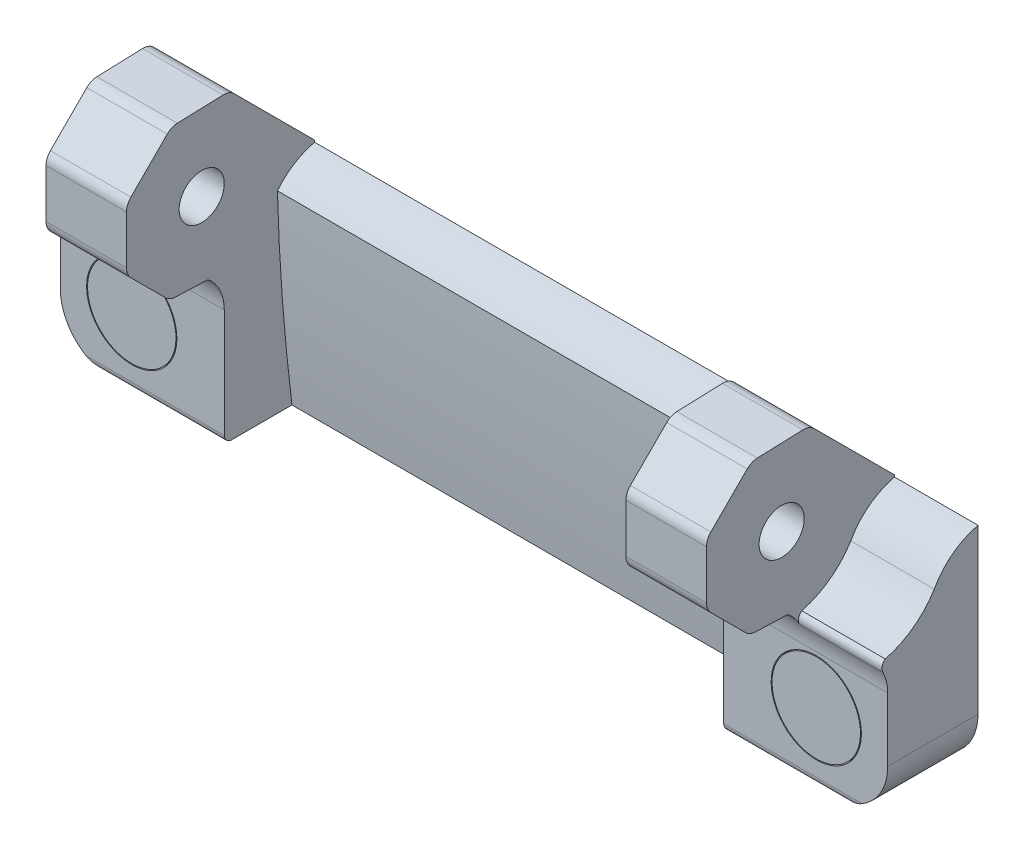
ISO-10303-21;
HEADER;
FILE_DESCRIPTION(('STEP AP214'),'2;1');
FILE_NAME('part.step','',(''),(''),'','','');
FILE_SCHEMA(('AUTOMOTIVE_DESIGN { 1 0 10303 214 1 1 1 1 }'));
ENDSEC;
DATA;
#1=APPLICATION_CONTEXT('core data for automotive mechanical design processes');
#2=APPLICATION_PROTOCOL_DEFINITION('international standard','automotive_design',2000,#1);
#3=PRODUCT_CONTEXT('',#1,'mechanical');
#4=PRODUCT('Part','Part','',(#3));
#5=PRODUCT_RELATED_PRODUCT_CATEGORY('part','',(#4));
#6=PRODUCT_DEFINITION_FORMATION('','',#4);
#7=PRODUCT_DEFINITION_CONTEXT('part definition',#1,'design');
#8=PRODUCT_DEFINITION('design','',#6,#7);
#9=PRODUCT_DEFINITION_SHAPE('','',#8);
#10=(LENGTH_UNIT() NAMED_UNIT(*) SI_UNIT(.MILLI.,.METRE.));
#11=(NAMED_UNIT(*) PLANE_ANGLE_UNIT() SI_UNIT($,.RADIAN.));
#12=(NAMED_UNIT(*) SI_UNIT($,.STERADIAN.) SOLID_ANGLE_UNIT());
#13=UNCERTAINTY_MEASURE_WITH_UNIT(LENGTH_MEASURE(1.E-05),#10,'distance_accuracy_value','');
#14=(GEOMETRIC_REPRESENTATION_CONTEXT(3) GLOBAL_UNCERTAINTY_ASSIGNED_CONTEXT((#13)) GLOBAL_UNIT_ASSIGNED_CONTEXT((#10,
#11,#12)) REPRESENTATION_CONTEXT('',''));
#15=CARTESIAN_POINT('',(0.,0.,0.));
#16=DIRECTION('',(0.,0.,1.));
#17=DIRECTION('',(1.,0.,0.));
#18=AXIS2_PLACEMENT_3D('',#15,#16,#17);
#19=CARTESIAN_POINT('',(100.5,6.44586474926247,17.8999999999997));
#20=DIRECTION('',(-1.,0.,0.));
#21=DIRECTION('',(0.,-1.,0.));
#22=AXIS2_PLACEMENT_3D('',#19,#20,#21);
#23=CYLINDRICAL_SURFACE('',#22,5.9);
#24=DIRECTION('',(-1.,0.,0.));
#25=VECTOR('',#24,1.);
#26=CARTESIAN_POINT('',(100.5,6.44586474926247,11.9999999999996));
#27=LINE('',#26,#25);
#28=CARTESIAN_POINT('',(12.3,6.44586474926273,12.));
#29=VERTEX_POINT('',#28);
#30=CARTESIAN_POINT('',(-9.5,6.44586474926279,12.));
#31=VERTEX_POINT('',#30);
#32=EDGE_CURVE('E478',#29,#31,#27,.T.);
#33=ORIENTED_EDGE('',*,*,#32,.F.);
#34=CARTESIAN_POINT('',(12.3,6.44586474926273,17.9));
#35=DIRECTION('',(1.,0.,0.));
#36=DIRECTION('',(0.,1.,0.));
#37=AXIS2_PLACEMENT_3D('',#34,#35,#36);
#38=CIRCLE('',#37,5.9);
#39=CARTESIAN_POINT('',(12.3,11.0173629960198,14.17020057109));
#40=VERTEX_POINT('',#39);
#41=EDGE_CURVE('E432',#29,#40,#38,.T.);
#42=ORIENTED_EDGE('',*,*,#41,.T.);
#43=DIRECTION('',(-1.,0.,0.));
#44=VECTOR('',#43,1.);
#45=CARTESIAN_POINT('',(100.5,11.0173629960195,14.1702005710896));
#46=LINE('',#45,#44);
#47=CARTESIAN_POINT('',(1.60000000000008,11.0173629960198,14.17020057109));
#48=VERTEX_POINT('',#47);
#49=EDGE_CURVE('E474',#40,#48,#46,.T.);
#50=ORIENTED_EDGE('',*,*,#49,.T.);
#51=CARTESIAN_POINT('',(1.60000000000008,6.44586474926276,17.9));
#52=DIRECTION('',(1.,0.,0.));
#53=DIRECTION('',(0.,1.,0.));
#54=AXIS2_PLACEMENT_3D('',#51,#52,#53);
#55=CIRCLE('',#54,5.9);
#56=CARTESIAN_POINT('',(1.60000000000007,9.13422394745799,12.648074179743));
#57=VERTEX_POINT('',#56);
#58=EDGE_CURVE('E424',#57,#48,#55,.T.);
#59=ORIENTED_EDGE('',*,*,#58,.F.);
#60=DIRECTION('',(-1.,0.,0.));
#61=VECTOR('',#60,1.);
#62=CARTESIAN_POINT('',(1.60000000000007,9.13422394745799,12.648074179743));
#63=LINE('',#62,#61);
#64=CARTESIAN_POINT('',(-9.5,9.13422394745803,12.648074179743));
#65=VERTEX_POINT('',#64);
#66=EDGE_CURVE('E650',#57,#65,#63,.T.);
#67=ORIENTED_EDGE('',*,*,#66,.T.);
#68=CARTESIAN_POINT('',(-9.5,6.44586474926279,17.9));
#69=DIRECTION('',(1.,0.,0.));
#70=DIRECTION('',(0.,1.,0.));
#71=AXIS2_PLACEMENT_3D('',#68,#69,#70);
#72=CIRCLE('',#71,5.9);
#73=EDGE_CURVE('E489',#31,#65,#72,.T.);
#74=ORIENTED_EDGE('',*,*,#73,.F.);
#75=EDGE_LOOP('',(#33,#42,#50,#59,#67,#74));
#76=FACE_BOUND('',#75,.T.);
#77=ADVANCED_FACE('F14',(#76),#23,.F.);
#78=CARTESIAN_POINT('',(100.5,6.44586474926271,11.9999999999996));
#79=DIRECTION('',(0.,0.,-1.));
#80=DIRECTION('',(-1.,0.,0.));
#81=AXIS2_PLACEMENT_3D('',#78,#79,#80);
#82=PLANE('',#81);
#83=CARTESIAN_POINT('',(0.,0.,12.));
#84=DIRECTION('',(0.,0.,1.));
#85=DIRECTION('',(0.,1.,0.));
#86=AXIS2_PLACEMENT_3D('',#83,#84,#85);
#87=CIRCLE('',#86,6.);
#88=CARTESIAN_POINT('',(0.,6.,12.));
#89=VERTEX_POINT('',#88);
#90=EDGE_CURVE('E346',#89,#89,#87,.T.);
#91=ORIENTED_EDGE('',*,*,#90,.F.);
#92=EDGE_LOOP('',(#91));
#93=FACE_BOUND('',#92,.T.);
#94=DIRECTION('',(0.,-1.,0.));
#95=VECTOR('',#94,1.);
#96=CARTESIAN_POINT('',(12.3,6.44586474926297,12.));
#97=LINE('',#96,#95);
#98=CARTESIAN_POINT('',(12.3,-8.,12.));
#99=VERTEX_POINT('',#98);
#100=EDGE_CURVE('E326',#29,#99,#97,.T.);
#101=ORIENTED_EDGE('',*,*,#100,.F.);
#102=ORIENTED_EDGE('',*,*,#32,.T.);
#103=DIRECTION('',(0.,-1.,0.));
#104=VECTOR('',#103,1.);
#105=CARTESIAN_POINT('',(-9.5,6.44586474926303,12.));
#106=LINE('',#105,#104);
#107=CARTESIAN_POINT('',(-9.5,-2.00000000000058,12.));
#108=VERTEX_POINT('',#107);
#109=EDGE_CURVE('E485',#31,#108,#106,.T.);
#110=ORIENTED_EDGE('',*,*,#109,.T.);
#111=CARTESIAN_POINT('',(-2.50000000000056,-2.00000000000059,12.));
#112=DIRECTION('',(0.,0.,-1.));
#113=DIRECTION('',(-1.,0.,0.));
#114=AXIS2_PLACEMENT_3D('',#111,#112,#113);
#115=CIRCLE('',#114,6.99999999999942);
#116=CARTESIAN_POINT('',(-6.10555127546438,-8.,12.));
#117=VERTEX_POINT('',#116);
#118=EDGE_CURVE('E398',#108,#117,#115,.F.);
#119=ORIENTED_EDGE('',*,*,#118,.T.);
#120=DIRECTION('',(-1.,0.,0.));
#121=VECTOR('',#120,1.);
#122=CARTESIAN_POINT('',(100.5,-8.00000000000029,11.9999999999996));
#123=LINE('',#122,#121);
#124=EDGE_CURVE('E482',#99,#117,#123,.T.);
#125=ORIENTED_EDGE('',*,*,#124,.F.);
#126=EDGE_LOOP('',(#101,#102,#110,#119,#125));
#127=FACE_BOUND('',#126,.T.);
#128=ADVANCED_FACE('F685',(#93,#127),#82,.F.);
#129=CARTESIAN_POINT('',(100.5,-8.00000000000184,11.0000000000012));
#130=DIRECTION('',(-1.,0.,0.));
#131=DIRECTION('',(0.,-1.,0.));
#132=AXIS2_PLACEMENT_3D('',#129,#130,#131);
#133=CYLINDRICAL_SURFACE('',#132,0.999999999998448);
#134=CARTESIAN_POINT('',(12.3,-8.00000000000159,11.0000000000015));
#135=DIRECTION('',(1.,0.,0.));
#136=DIRECTION('',(0.,1.,0.));
#137=AXIS2_PLACEMENT_3D('',#134,#135,#136);
#138=CIRCLE('',#137,0.999999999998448);
#139=CARTESIAN_POINT('',(12.3,-9.,11.0000000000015));
#140=VERTEX_POINT('',#139);
#141=EDGE_CURVE('E311',#99,#140,#138,.T.);
#142=ORIENTED_EDGE('',*,*,#141,.F.);
#143=ORIENTED_EDGE('',*,*,#124,.T.);
#144=CARTESIAN_POINT('',(-6.10555127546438,-8.,12.));
#145=CARTESIAN_POINT('',(-6.05494177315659,-8.0304138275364,11.9999929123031));
#146=CARTESIAN_POINT('',(-6.00396296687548,-8.06017529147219,11.9986134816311));
#147=CARTESIAN_POINT('',(-5.90138529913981,-8.11833715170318,11.9934039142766));
#148=CARTESIAN_POINT('',(-5.84978671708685,-8.14673813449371,11.989574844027));
#149=CARTESIAN_POINT('',(-5.69441978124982,-8.22972265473,11.9748751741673));
#150=CARTESIAN_POINT('',(-5.58983806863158,-8.28223313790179,11.9607892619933));
#151=CARTESIAN_POINT('',(-5.37967288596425,-8.38129477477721,11.9259356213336));
#152=CARTESIAN_POINT('',(-5.27409682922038,-8.42787385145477,11.9052009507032));
#153=CARTESIAN_POINT('',(-5.06173841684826,-8.51542025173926,11.8583738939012));
#154=CARTESIAN_POINT('',(-4.95495516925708,-8.55638308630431,11.8322772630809));
#155=CARTESIAN_POINT('',(-4.65662199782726,-8.66259073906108,11.7537528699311));
#156=CARTESIAN_POINT('',(-4.46409833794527,-8.72176788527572,11.6966952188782));
#157=CARTESIAN_POINT('',(-4.07742895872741,-8.82288362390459,11.5737581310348));
#158=CARTESIAN_POINT('',(-3.88328226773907,-8.86481100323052,11.5078729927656));
#159=CARTESIAN_POINT('',(-3.29892919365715,-8.96548017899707,11.3019885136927));
#160=CARTESIAN_POINT('',(-2.9068117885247,-8.99910832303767,11.1537607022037));
#161=CARTESIAN_POINT('',(-2.51043481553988,-8.99999416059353,11.0039439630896));
#162=CARTESIAN_POINT('',(-2.50521731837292,-8.99999999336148,11.0019719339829));
#163=CARTESIAN_POINT('',(-2.50000000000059,-9.,11.0000000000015));
#164=B_SPLINE_CURVE_WITH_KNOTS('',3,(#144,#145,#146,#147,#148,#149,#150,#151,#152,#153,#154,
#155,#156,#157,#158,#159,#160,#161,#162,#163),.UNSPECIFIED.,.F.,.F.,(4,2,2,2,2,2,2,2,2,4),(0.,
0.177083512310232,0.354089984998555,0.707258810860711,1.05869820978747,1.41041689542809,
2.03723640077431,2.66446272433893,3.91892182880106,3.93565503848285),.UNSPECIFIED.);
#165=CARTESIAN_POINT('',(-2.5,-9.,11.0000000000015));
#166=VERTEX_POINT('',#165);
#167=EDGE_CURVE('E389',#117,#166,#164,.T.);
#168=ORIENTED_EDGE('',*,*,#167,.T.);
#169=DIRECTION('',(-1.,0.,0.));
#170=VECTOR('',#169,1.);
#171=CARTESIAN_POINT('',(100.5,-9.00000000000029,11.0000000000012));
#172=LINE('',#171,#170);
#173=EDGE_CURVE('E484',#140,#166,#172,.T.);
#174=ORIENTED_EDGE('',*,*,#173,.F.);
#175=EDGE_LOOP('',(#142,#143,#168,#174));
#176=FACE_BOUND('',#175,.T.);
#177=ADVANCED_FACE('F772',(#176),#133,.T.);
#178=CARTESIAN_POINT('',(100.5,-9.00000000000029,-3.47891739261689E-13));
#179=DIRECTION('',(0.,0.,1.));
#180=DIRECTION('',(1.,0.,0.));
#181=AXIS2_PLACEMENT_3D('',#178,#179,#180);
#182=PLANE('',#181);
#183=CARTESIAN_POINT('',(0.,0.,0.));
#184=DIRECTION('',(0.,0.,1.));
#185=DIRECTION('',(1.,0.,0.));
#186=AXIS2_PLACEMENT_3D('',#183,#184,#185);
#187=CIRCLE('',#186,3.25);
#188=CARTESIAN_POINT('',(3.25,0.,0.));
#189=VERTEX_POINT('',#188);
#190=EDGE_CURVE('E372',#189,#189,#187,.T.);
#191=ORIENTED_EDGE('',*,*,#190,.T.);
#192=EDGE_LOOP('',(#191));
#193=FACE_BOUND('',#192,.T.);
#194=DIRECTION('',(0.,1.,0.));
#195=VECTOR('',#194,1.);
#196=CARTESIAN_POINT('',(100.5,-9.00000000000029,-3.47891739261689E-13));
#197=LINE('',#196,#195);
#198=CARTESIAN_POINT('',(100.5,-2.00000000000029,-3.47891739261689E-13));
#199=VERTEX_POINT('',#198);
#200=CARTESIAN_POINT('',(100.5,19.7557884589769,-3.44422292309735E-13));
#201=VERTEX_POINT('',#200);
#202=EDGE_CURVE('E488',#199,#201,#197,.T.);
#203=ORIENTED_EDGE('',*,*,#202,.F.);
#204=CARTESIAN_POINT('',(93.5,-2.00000000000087,-3.23660473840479E-13));
#205=DIRECTION('',(0.,0.,1.));
#206=DIRECTION('',(0.,1.,0.));
#207=AXIS2_PLACEMENT_3D('',#204,#205,#206);
#208=CIRCLE('',#207,6.99999999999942);
#209=CARTESIAN_POINT('',(93.5,-9.00000000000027,-3.23660473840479E-13));
#210=VERTEX_POINT('',#209);
#211=EDGE_CURVE('E375',#210,#199,#208,.T.);
#212=ORIENTED_EDGE('',*,*,#211,.F.);
#213=DIRECTION('',(-1.,0.,0.));
#214=VECTOR('',#213,1.);
#215=CARTESIAN_POINT('',(100.5,-9.00000000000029,-3.47891739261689E-13));
#216=LINE('',#215,#214);
#217=CARTESIAN_POINT('',(-2.5,-9.,0.));
#218=VERTEX_POINT('',#217);
#219=EDGE_CURVE('E435',#210,#218,#216,.T.);
#220=ORIENTED_EDGE('',*,*,#219,.T.);
#221=CARTESIAN_POINT('',(-2.5000000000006,-2.00000000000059,0.));
#222=DIRECTION('',(0.,0.,1.));
#223=DIRECTION('',(0.,1.,0.));
#224=AXIS2_PLACEMENT_3D('',#221,#222,#223);
#225=CIRCLE('',#224,6.99999999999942);
#226=CARTESIAN_POINT('',(-9.5,-2.00000000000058,0.));
#227=VERTEX_POINT('',#226);
#228=EDGE_CURVE('E377',#227,#218,#225,.T.);
#229=ORIENTED_EDGE('',*,*,#228,.F.);
#230=DIRECTION('',(0.,1.,0.));
#231=VECTOR('',#230,1.);
#232=CARTESIAN_POINT('',(-9.5,-9.,0.));
#233=LINE('',#232,#231);
#234=CARTESIAN_POINT('',(-9.5,19.7557884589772,0.));
#235=VERTEX_POINT('',#234);
#236=EDGE_CURVE('E492',#227,#235,#233,.T.);
#237=ORIENTED_EDGE('',*,*,#236,.T.);
#238=DIRECTION('',(-1.,0.,0.));
#239=VECTOR('',#238,1.);
#240=CARTESIAN_POINT('',(1.60000000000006,19.7557884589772,0.));
#241=LINE('',#240,#239);
#242=CARTESIAN_POINT('',(1.60000000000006,19.7557884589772,0.));
#243=VERTEX_POINT('',#242);
#244=EDGE_CURVE('E657',#243,#235,#241,.T.);
#245=ORIENTED_EDGE('',*,*,#244,.F.);
#246=DIRECTION('',(0.,1.,0.));
#247=VECTOR('',#246,1.);
#248=CARTESIAN_POINT('',(1.60000000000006,19.7557884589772,0.));
#249=LINE('',#248,#247);
#250=CARTESIAN_POINT('',(1.60000000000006,20.0039946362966,0.));
#251=VERTEX_POINT('',#250);
#252=EDGE_CURVE('E660',#243,#251,#249,.T.);
#253=ORIENTED_EDGE('',*,*,#252,.T.);
#254=DIRECTION('',(-1.,0.,0.));
#255=VECTOR('',#254,1.);
#256=CARTESIAN_POINT('',(100.5,20.0039946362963,-3.4789173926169E-13));
#257=LINE('',#256,#255);
#258=CARTESIAN_POINT('',(12.3,20.0039946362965,0.));
#259=VERTEX_POINT('',#258);
#260=EDGE_CURVE('E440',#259,#251,#257,.T.);
#261=ORIENTED_EDGE('',*,*,#260,.F.);
#262=DIRECTION('',(0.,1.,0.));
#263=VECTOR('',#262,1.);
#264=CARTESIAN_POINT('',(12.3,19.7557884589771,0.));
#265=LINE('',#264,#263);
#266=CARTESIAN_POINT('',(12.3,19.7557884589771,0.));
#267=VERTEX_POINT('',#266);
#268=EDGE_CURVE('E558',#267,#259,#265,.T.);
#269=ORIENTED_EDGE('',*,*,#268,.F.);
#270=DIRECTION('',(-1.,0.,0.));
#271=VECTOR('',#270,1.);
#272=CARTESIAN_POINT('',(78.7,19.755788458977,-2.68959208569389E-13));
#273=LINE('',#272,#271);
#274=CARTESIAN_POINT('',(78.7,19.755788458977,-2.68959208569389E-13));
#275=VERTEX_POINT('',#274);
#276=EDGE_CURVE('E555',#275,#267,#273,.T.);
#277=ORIENTED_EDGE('',*,*,#276,.F.);
#278=DIRECTION('',(0.,1.,0.));
#279=VECTOR('',#278,1.);
#280=CARTESIAN_POINT('',(78.7,19.755788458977,-2.72428655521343E-13));
#281=LINE('',#280,#279);
#282=CARTESIAN_POINT('',(78.7,20.0039946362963,-2.72428655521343E-13));
#283=VERTEX_POINT('',#282);
#284=EDGE_CURVE('E557',#275,#283,#281,.T.);
#285=ORIENTED_EDGE('',*,*,#284,.T.);
#286=CARTESIAN_POINT('',(89.4,20.0039946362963,-3.09467875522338E-13));
#287=VERTEX_POINT('',#286);
#288=EDGE_CURVE('E438',#287,#283,#257,.T.);
#289=ORIENTED_EDGE('',*,*,#288,.F.);
#290=DIRECTION('',(0.,1.,0.));
#291=VECTOR('',#290,1.);
#292=CARTESIAN_POINT('',(89.4,19.755788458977,-3.09467875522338E-13));
#293=LINE('',#292,#291);
#294=CARTESIAN_POINT('',(89.4,19.755788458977,-3.05998428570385E-13));
#295=VERTEX_POINT('',#294);
#296=EDGE_CURVE('E598',#295,#287,#293,.T.);
#297=ORIENTED_EDGE('',*,*,#296,.F.);
#298=DIRECTION('',(1.,0.,0.));
#299=VECTOR('',#298,1.);
#300=CARTESIAN_POINT('',(89.4,19.755788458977,-3.05998428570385E-13));
#301=LINE('',#300,#299);
#302=EDGE_CURVE('E595',#295,#201,#301,.T.);
#303=ORIENTED_EDGE('',*,*,#302,.T.);
#304=EDGE_LOOP('',(#203,#212,#220,#229,#237,#245,#253,#261,#269,#277,#285,#289,#297,#303));
#305=FACE_BOUND('',#304,.T.);
#306=CARTESIAN_POINT('',(91.,-2.63677968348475E-13,-3.15006450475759E-13));
#307=DIRECTION('',(0.,0.,1.));
#308=DIRECTION('',(1.,0.,0.));
#309=AXIS2_PLACEMENT_3D('',#306,#307,#308);
#310=CIRCLE('',#309,3.25);
#311=CARTESIAN_POINT('',(94.25,-2.72975328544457E-13,-3.26256680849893E-13));
#312=VERTEX_POINT('',#311);
#313=EDGE_CURVE('E339',#312,#312,#310,.T.);
#314=ORIENTED_EDGE('',*,*,#313,.T.);
#315=EDGE_LOOP('',(#314));
#316=FACE_BOUND('',#315,.T.);
#317=ADVANCED_FACE('F699',(#193,#305,#316),#182,.F.);
#318=CARTESIAN_POINT('',(100.5,-9.00000000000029,10.9999999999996));
#319=DIRECTION('',(0.,1.,0.));
#320=DIRECTION('',(-1.,0.,0.));
#321=AXIS2_PLACEMENT_3D('',#318,#319,#320);
#322=PLANE('',#321);
#323=CARTESIAN_POINT('',(93.5,-9.00000000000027,11.0000000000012));
#324=VERTEX_POINT('',#323);
#325=CARTESIAN_POINT('',(78.7,-9.00000000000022,11.0000000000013));
#326=VERTEX_POINT('',#325);
#327=EDGE_CURVE('E316',#324,#326,#172,.T.);
#328=ORIENTED_EDGE('',*,*,#327,.T.);
#329=DIRECTION('',(0.,0.,-1.));
#330=VECTOR('',#329,1.);
#331=CARTESIAN_POINT('',(78.7,-9.00000000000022,14.9999999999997));
#332=LINE('',#331,#330);
#333=CARTESIAN_POINT('',(78.7,-9.00000000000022,2.99999999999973));
#334=VERTEX_POINT('',#333);
#335=EDGE_CURVE('E300',#326,#334,#332,.T.);
#336=ORIENTED_EDGE('',*,*,#335,.T.);
#337=DIRECTION('',(-1.,0.,0.));
#338=VECTOR('',#337,1.);
#339=CARTESIAN_POINT('',(78.7,-9.00000000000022,2.99999999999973));
#340=LINE('',#339,#338);
#341=CARTESIAN_POINT('',(12.3,-9.,2.99999999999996));
#342=VERTEX_POINT('',#341);
#343=EDGE_CURVE('E305',#334,#342,#340,.T.);
#344=ORIENTED_EDGE('',*,*,#343,.T.);
#345=DIRECTION('',(0.,0.,-1.));
#346=VECTOR('',#345,1.);
#347=CARTESIAN_POINT('',(12.3,-9.,15.));
#348=LINE('',#347,#346);
#349=EDGE_CURVE('E318',#140,#342,#348,.T.);
#350=ORIENTED_EDGE('',*,*,#349,.F.);
#351=ORIENTED_EDGE('',*,*,#173,.T.);
#352=DIRECTION('',(0.,0.,-1.));
#353=VECTOR('',#352,1.);
#354=CARTESIAN_POINT('',(-2.49999999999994,-9.,25.));
#355=LINE('',#354,#353);
#356=EDGE_CURVE('E381',#166,#218,#355,.T.);
#357=ORIENTED_EDGE('',*,*,#356,.T.);
#358=ORIENTED_EDGE('',*,*,#219,.F.);
#359=DIRECTION('',(0.,0.,-1.));
#360=VECTOR('',#359,1.);
#361=CARTESIAN_POINT('',(93.5,-9.00000000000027,24.9999999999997));
#362=LINE('',#361,#360);
#363=EDGE_CURVE('E384',#324,#210,#362,.T.);
#364=ORIENTED_EDGE('',*,*,#363,.F.);
#365=EDGE_LOOP('',(#328,#336,#344,#350,#351,#357,#358,#364));
#366=FACE_BOUND('',#365,.T.);
#367=ADVANCED_FACE('F16',(#366),#322,.F.);
#368=CARTESIAN_POINT('',(78.7,6.44586474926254,17.8999999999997));
#369=DIRECTION('',(1.,0.,0.));
#370=DIRECTION('',(0.,1.,0.));
#371=AXIS2_PLACEMENT_3D('',#368,#369,#370);
#372=CIRCLE('',#371,5.9);
#373=CARTESIAN_POINT('',(78.7,6.44586474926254,11.9999999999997));
#374=VERTEX_POINT('',#373);
#375=CARTESIAN_POINT('',(78.7,11.0173629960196,14.1702005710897));
#376=VERTEX_POINT('',#375);
#377=EDGE_CURVE('E429',#374,#376,#372,.T.);
#378=ORIENTED_EDGE('',*,*,#377,.F.);
#379=CARTESIAN_POINT('',(100.5,6.44586474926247,11.9999999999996));
#380=VERTEX_POINT('',#379);
#381=EDGE_CURVE('E475',#380,#374,#27,.T.);
#382=ORIENTED_EDGE('',*,*,#381,.F.);
#383=CARTESIAN_POINT('',(100.5,6.44586474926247,17.8999999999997));
#384=DIRECTION('',(1.,0.,0.));
#385=DIRECTION('',(0.,1.,0.));
#386=AXIS2_PLACEMENT_3D('',#383,#384,#385);
#387=CIRCLE('',#386,5.9);
#388=CARTESIAN_POINT('',(100.5,9.13422394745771,12.6480741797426));
#389=VERTEX_POINT('',#388);
#390=EDGE_CURVE('E498',#380,#389,#387,.T.);
#391=ORIENTED_EDGE('',*,*,#390,.T.);
#392=DIRECTION('',(1.,0.,0.));
#393=VECTOR('',#392,1.);
#394=CARTESIAN_POINT('',(89.4,9.13422394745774,12.6480741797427));
#395=LINE('',#394,#393);
#396=CARTESIAN_POINT('',(89.4,9.13422394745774,12.6480741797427));
#397=VERTEX_POINT('',#396);
#398=EDGE_CURVE('E588',#397,#389,#395,.T.);
#399=ORIENTED_EDGE('',*,*,#398,.F.);
#400=CARTESIAN_POINT('',(89.4,6.44586474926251,17.8999999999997));
#401=DIRECTION('',(1.,0.,0.));
#402=DIRECTION('',(0.,1.,0.));
#403=AXIS2_PLACEMENT_3D('',#400,#401,#402);
#404=CIRCLE('',#403,5.9);
#405=CARTESIAN_POINT('',(89.4,11.0173629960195,14.1702005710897));
#406=VERTEX_POINT('',#405);
#407=EDGE_CURVE('E426',#397,#406,#404,.T.);
#408=ORIENTED_EDGE('',*,*,#407,.T.);
#409=EDGE_CURVE('E471',#406,#376,#46,.T.);
#410=ORIENTED_EDGE('',*,*,#409,.T.);
#411=EDGE_LOOP('',(#378,#382,#391,#399,#408,#410));
#412=FACE_BOUND('',#411,.T.);
#413=ADVANCED_FACE('F781',(#412),#23,.F.);
#414=CARTESIAN_POINT('',(100.5,20.0039946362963,-3.4789173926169E-13));
#415=DIRECTION('',(0.,-0.707106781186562,0.707106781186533));
#416=DIRECTION('',(0.,-0.707106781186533,-0.707106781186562));
#417=AXIS2_PLACEMENT_3D('',#414,#415,#416);
#418=PLANE('',#417);
#419=DIRECTION('',(0.,0.707106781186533,0.707106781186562));
#420=VECTOR('',#419,1.);
#421=CARTESIAN_POINT('',(89.4,20.0039946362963,-3.09467875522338E-13));
#422=LINE('',#421,#420);
#423=CARTESIAN_POINT('',(89.4,30.6890770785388,10.6850824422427));
#424=VERTEX_POINT('',#423);
#425=EDGE_CURVE('E563',#287,#424,#422,.T.);
#426=ORIENTED_EDGE('',*,*,#425,.F.);
#427=ORIENTED_EDGE('',*,*,#288,.T.);
#428=DIRECTION('',(0.,0.707106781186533,0.707106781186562));
#429=VECTOR('',#428,1.);
#430=CARTESIAN_POINT('',(78.7,20.0039946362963,-2.72428655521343E-13));
#431=LINE('',#430,#429);
#432=CARTESIAN_POINT('',(78.7,30.6890770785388,10.6850824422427));
#433=VERTEX_POINT('',#432);
#434=EDGE_CURVE('E494',#283,#433,#431,.T.);
#435=ORIENTED_EDGE('',*,*,#434,.T.);
#436=DIRECTION('',(-1.,0.,0.));
#437=VECTOR('',#436,1.);
#438=CARTESIAN_POINT('',(100.5,30.6890770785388,10.6850824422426));
#439=LINE('',#438,#437);
#440=EDGE_CURVE('E441',#424,#433,#439,.T.);
#441=ORIENTED_EDGE('',*,*,#440,.F.);
#442=EDGE_LOOP('',(#426,#427,#435,#441));
#443=FACE_BOUND('',#442,.T.);
#444=ADVANCED_FACE('F806',(#443),#418,.F.);
#445=CARTESIAN_POINT('',(100.5,29.2748635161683,12.0992960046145));
#446=DIRECTION('',(-1.,0.,0.));
#447=DIRECTION('',(0.,-1.,0.));
#448=AXIS2_PLACEMENT_3D('',#445,#446,#447);
#449=CYLINDRICAL_SURFACE('',#448,1.99999999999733);
#450=CARTESIAN_POINT('',(89.4,29.2748635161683,12.0992960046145));
#451=DIRECTION('',(1.,0.,0.));
#452=DIRECTION('',(0.,1.,0.));
#453=AXIS2_PLACEMENT_3D('',#450,#451,#452);
#454=CIRCLE('',#453,1.99999999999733);
#455=CARTESIAN_POINT('',(89.4,31.2736451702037,12.1690949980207));
#456=VERTEX_POINT('',#455);
#457=EDGE_CURVE('E568',#424,#456,#454,.T.);
#458=ORIENTED_EDGE('',*,*,#457,.F.);
#459=ORIENTED_EDGE('',*,*,#440,.T.);
#460=CARTESIAN_POINT('',(78.7,29.2748635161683,12.0992960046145));
#461=DIRECTION('',(1.,0.,0.));
#462=DIRECTION('',(0.,1.,0.));
#463=AXIS2_PLACEMENT_3D('',#460,#461,#462);
#464=CIRCLE('',#463,1.99999999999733);
#465=CARTESIAN_POINT('',(78.7,31.2736451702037,12.1690949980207));
#466=VERTEX_POINT('',#465);
#467=EDGE_CURVE('E504',#433,#466,#464,.T.);
#468=ORIENTED_EDGE('',*,*,#467,.T.);
#469=DIRECTION('',(-1.,0.,0.));
#470=VECTOR('',#469,1.);
#471=CARTESIAN_POINT('',(100.5,31.2736451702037,12.1690949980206));
#472=LINE('',#471,#470);
#473=EDGE_CURVE('E444',#456,#466,#472,.T.);
#474=ORIENTED_EDGE('',*,*,#473,.F.);
#475=EDGE_LOOP('',(#458,#459,#468,#474));
#476=FACE_BOUND('',#475,.T.);
#477=ADVANCED_FACE('F812',(#476),#449,.T.);
#478=CARTESIAN_POINT('',(100.5,31.2736451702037,12.1690949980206));
#479=DIRECTION('',(0.,-0.999390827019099,-0.0348994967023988));
#480=DIRECTION('',(0.,0.0348994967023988,-0.999390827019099));
#481=AXIS2_PLACEMENT_3D('',#478,#479,#480);
#482=PLANE('',#481);
#483=DIRECTION('',(0.,-0.0348994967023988,0.999390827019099));
#484=VECTOR('',#483,1.);
#485=CARTESIAN_POINT('',(89.4,31.2736451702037,12.1690949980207));
#486=LINE('',#485,#484);
#487=CARTESIAN_POINT('',(89.4,31.0618704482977,18.2335295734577));
#488=VERTEX_POINT('',#487);
#489=EDGE_CURVE('E570',#456,#488,#486,.T.);
#490=ORIENTED_EDGE('',*,*,#489,.F.);
#491=ORIENTED_EDGE('',*,*,#473,.T.);
#492=DIRECTION('',(0.,-0.0348994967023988,0.999390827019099));
#493=VECTOR('',#492,1.);
#494=CARTESIAN_POINT('',(78.7,31.2736451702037,12.1690949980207));
#495=LINE('',#494,#493);
#496=CARTESIAN_POINT('',(78.7,31.0618704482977,18.2335295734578));
#497=VERTEX_POINT('',#496);
#498=EDGE_CURVE('E507',#466,#497,#495,.T.);
#499=ORIENTED_EDGE('',*,*,#498,.T.);
#500=DIRECTION('',(-1.,0.,0.));
#501=VECTOR('',#500,1.);
#502=CARTESIAN_POINT('',(100.5,31.0618704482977,18.2335295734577));
#503=LINE('',#502,#501);
#504=EDGE_CURVE('E447',#488,#497,#503,.T.);
#505=ORIENTED_EDGE('',*,*,#504,.F.);
#506=EDGE_LOOP('',(#490,#491,#499,#505));
#507=FACE_BOUND('',#506,.T.);
#508=ADVANCED_FACE('F826',(#507),#482,.F.);
#509=CARTESIAN_POINT('',(100.5,29.0630887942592,18.163730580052));
#510=DIRECTION('',(-1.,0.,0.));
#511=DIRECTION('',(0.,-1.,0.));
#512=AXIS2_PLACEMENT_3D('',#509,#510,#511);
#513=CYLINDRICAL_SURFACE('',#512,2.00000000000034);
#514=CARTESIAN_POINT('',(89.4,29.0630887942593,18.163730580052));
#515=DIRECTION('',(1.,0.,0.));
#516=DIRECTION('',(0.,1.,0.));
#517=AXIS2_PLACEMENT_3D('',#514,#515,#516);
#518=CIRCLE('',#517,2.00000000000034);
#519=CARTESIAN_POINT('',(89.4,30.4773023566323,19.5779441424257));
#520=VERTEX_POINT('',#519);
#521=EDGE_CURVE('E572',#488,#520,#518,.T.);
#522=ORIENTED_EDGE('',*,*,#521,.F.);
#523=ORIENTED_EDGE('',*,*,#504,.T.);
#524=CARTESIAN_POINT('',(78.7,29.0630887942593,18.1637305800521));
#525=DIRECTION('',(1.,0.,0.));
#526=DIRECTION('',(0.,1.,0.));
#527=AXIS2_PLACEMENT_3D('',#524,#525,#526);
#528=CIRCLE('',#527,2.00000000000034);
#529=CARTESIAN_POINT('',(78.7,30.4773023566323,19.5779441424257));
#530=VERTEX_POINT('',#529);
#531=EDGE_CURVE('E510',#497,#530,#528,.T.);
#532=ORIENTED_EDGE('',*,*,#531,.T.);
#533=DIRECTION('',(-1.,0.,0.));
#534=VECTOR('',#533,1.);
#535=CARTESIAN_POINT('',(100.5,30.4773023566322,19.5779441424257));
#536=LINE('',#535,#534);
#537=EDGE_CURVE('E450',#520,#530,#536,.T.);
#538=ORIENTED_EDGE('',*,*,#537,.F.);
#539=EDGE_LOOP('',(#522,#523,#532,#538));
#540=FACE_BOUND('',#539,.T.);
#541=ADVANCED_FACE('F830',(#540),#513,.T.);
#542=CARTESIAN_POINT('',(100.5,30.4773023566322,19.5779441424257));
#543=DIRECTION('',(0.,-0.70710678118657,-0.707106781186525));
#544=DIRECTION('',(0.,0.707106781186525,-0.70710678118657));
#545=AXIS2_PLACEMENT_3D('',#542,#543,#544);
#546=PLANE('',#545);
#547=DIRECTION('',(0.,-0.707106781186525,0.70710678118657));
#548=VECTOR('',#547,1.);
#549=CARTESIAN_POINT('',(89.4,30.4773023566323,19.5779441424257));
#550=LINE('',#549,#548);
#551=CARTESIAN_POINT('',(89.4,25.6410329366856,24.4142135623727));
#552=VERTEX_POINT('',#551);
#553=EDGE_CURVE('E574',#520,#552,#550,.T.);
#554=ORIENTED_EDGE('',*,*,#553,.F.);
#555=ORIENTED_EDGE('',*,*,#537,.T.);
#556=DIRECTION('',(0.,-0.707106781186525,0.70710678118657));
#557=VECTOR('',#556,1.);
#558=CARTESIAN_POINT('',(78.7,30.4773023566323,19.5779441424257));
#559=LINE('',#558,#557);
#560=CARTESIAN_POINT('',(78.7,25.6410329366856,24.4142135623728));
#561=VERTEX_POINT('',#560);
#562=EDGE_CURVE('E513',#530,#561,#559,.T.);
#563=ORIENTED_EDGE('',*,*,#562,.T.);
#564=DIRECTION('',(-1.,0.,0.));
#565=VECTOR('',#564,1.);
#566=CARTESIAN_POINT('',(100.5,25.6410329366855,24.4142135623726));
#567=LINE('',#566,#565);
#568=EDGE_CURVE('E453',#552,#561,#567,.T.);
#569=ORIENTED_EDGE('',*,*,#568,.F.);
#570=EDGE_LOOP('',(#554,#555,#563,#569));
#571=FACE_BOUND('',#570,.T.);
#572=ADVANCED_FACE('F834',(#571),#546,.F.);
#573=CARTESIAN_POINT('',(100.5,24.2268193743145,23.0000000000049));
#574=DIRECTION('',(-1.,0.,0.));
#575=DIRECTION('',(0.,-1.,0.));
#576=AXIS2_PLACEMENT_3D('',#573,#574,#575);
#577=CYLINDRICAL_SURFACE('',#576,1.99999999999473);
#578=CARTESIAN_POINT('',(89.4,24.2268193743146,23.0000000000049));
#579=DIRECTION('',(1.,0.,0.));
#580=DIRECTION('',(0.,1.,0.));
#581=AXIS2_PLACEMENT_3D('',#578,#579,#580);
#582=CIRCLE('',#581,1.99999999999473);
#583=CARTESIAN_POINT('',(89.4,24.2268193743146,24.9999999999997));
#584=VERTEX_POINT('',#583);
#585=EDGE_CURVE('E576',#552,#584,#582,.T.);
#586=ORIENTED_EDGE('',*,*,#585,.F.);
#587=ORIENTED_EDGE('',*,*,#568,.T.);
#588=CARTESIAN_POINT('',(78.7,24.2268193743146,23.000000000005));
#589=DIRECTION('',(1.,0.,0.));
#590=DIRECTION('',(0.,1.,0.));
#591=AXIS2_PLACEMENT_3D('',#588,#589,#590);
#592=CIRCLE('',#591,1.99999999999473);
#593=CARTESIAN_POINT('',(78.7,24.2268193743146,24.9999999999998));
#594=VERTEX_POINT('',#593);
#595=EDGE_CURVE('E516',#561,#594,#592,.T.);
#596=ORIENTED_EDGE('',*,*,#595,.T.);
#597=DIRECTION('',(-1.,0.,0.));
#598=VECTOR('',#597,1.);
#599=CARTESIAN_POINT('',(100.5,24.2268193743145,24.9999999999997));
#600=LINE('',#599,#598);
#601=EDGE_CURVE('E456',#584,#594,#600,.T.);
#602=ORIENTED_EDGE('',*,*,#601,.F.);
#603=EDGE_LOOP('',(#586,#587,#596,#602));
#604=FACE_BOUND('',#603,.T.);
#605=ADVANCED_FACE('F838',(#604),#577,.T.);
#606=CARTESIAN_POINT('',(100.5,24.2268193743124,24.9999999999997));
#607=DIRECTION('',(0.,0.,-1.));
#608=DIRECTION('',(-1.,0.,0.));
#609=AXIS2_PLACEMENT_3D('',#606,#607,#608);
#610=PLANE('',#609);
#611=DIRECTION('',(0.,-1.,0.));
#612=VECTOR('',#611,1.);
#613=CARTESIAN_POINT('',(89.4,24.2268193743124,24.9999999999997));
#614=LINE('',#613,#612);
#615=CARTESIAN_POINT('',(89.4,17.7731806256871,24.9999999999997));
#616=VERTEX_POINT('',#615);
#617=EDGE_CURVE('E578',#584,#616,#614,.T.);
#618=ORIENTED_EDGE('',*,*,#617,.F.);
#619=ORIENTED_EDGE('',*,*,#601,.T.);
#620=DIRECTION('',(0.,-1.,0.));
#621=VECTOR('',#620,1.);
#622=CARTESIAN_POINT('',(78.7,24.2268193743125,24.9999999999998));
#623=LINE('',#622,#621);
#624=CARTESIAN_POINT('',(78.7,17.7731806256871,24.9999999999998));
#625=VERTEX_POINT('',#624);
#626=EDGE_CURVE('E519',#594,#625,#623,.T.);
#627=ORIENTED_EDGE('',*,*,#626,.T.);
#628=DIRECTION('',(-1.,0.,0.));
#629=VECTOR('',#628,1.);
#630=CARTESIAN_POINT('',(100.5,17.773180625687,24.9999999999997));
#631=LINE('',#630,#629);
#632=EDGE_CURVE('E459',#616,#625,#631,.T.);
#633=ORIENTED_EDGE('',*,*,#632,.F.);
#634=EDGE_LOOP('',(#618,#619,#627,#633));
#635=FACE_BOUND('',#634,.T.);
#636=ADVANCED_FACE('F842',(#635),#610,.F.);
#637=CARTESIAN_POINT('',(100.5,17.7731806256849,23.0000000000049));
#638=DIRECTION('',(-1.,0.,0.));
#639=DIRECTION('',(0.,-1.,0.));
#640=AXIS2_PLACEMENT_3D('',#637,#638,#639);
#641=CYLINDRICAL_SURFACE('',#640,1.99999999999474);
#642=CARTESIAN_POINT('',(89.4,17.7731806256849,23.0000000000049));
#643=DIRECTION('',(1.,0.,0.));
#644=DIRECTION('',(0.,1.,0.));
#645=AXIS2_PLACEMENT_3D('',#642,#643,#644);
#646=CIRCLE('',#645,1.99999999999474);
#647=CARTESIAN_POINT('',(89.4,16.358967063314,24.4142135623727));
#648=VERTEX_POINT('',#647);
#649=EDGE_CURVE('E580',#616,#648,#646,.T.);
#650=ORIENTED_EDGE('',*,*,#649,.F.);
#651=ORIENTED_EDGE('',*,*,#632,.T.);
#652=CARTESIAN_POINT('',(78.7,17.773180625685,23.000000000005));
#653=DIRECTION('',(1.,0.,0.));
#654=DIRECTION('',(0.,1.,0.));
#655=AXIS2_PLACEMENT_3D('',#652,#653,#654);
#656=CIRCLE('',#655,1.99999999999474);
#657=CARTESIAN_POINT('',(78.7,16.358967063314,24.4142135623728));
#658=VERTEX_POINT('',#657);
#659=EDGE_CURVE('E522',#625,#658,#656,.T.);
#660=ORIENTED_EDGE('',*,*,#659,.T.);
#661=DIRECTION('',(-1.,0.,0.));
#662=VECTOR('',#661,1.);
#663=CARTESIAN_POINT('',(100.5,16.3589670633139,24.4142135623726));
#664=LINE('',#663,#662);
#665=EDGE_CURVE('E462',#648,#658,#664,.T.);
#666=ORIENTED_EDGE('',*,*,#665,.F.);
#667=EDGE_LOOP('',(#650,#651,#660,#666));
#668=FACE_BOUND('',#667,.T.);
#669=ADVANCED_FACE('F846',(#668),#641,.T.);
#670=CARTESIAN_POINT('',(100.5,16.3589670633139,24.4142135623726));
#671=DIRECTION('',(0.,0.707106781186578,-0.707106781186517));
#672=DIRECTION('',(0.,0.707106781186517,0.707106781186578));
#673=AXIS2_PLACEMENT_3D('',#670,#671,#672);
#674=PLANE('',#673);
#675=DIRECTION('',(0.,-0.707106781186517,-0.707106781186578));
#676=VECTOR('',#675,1.);
#677=CARTESIAN_POINT('',(89.4,16.358967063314,24.4142135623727));
#678=LINE('',#677,#676);
#679=CARTESIAN_POINT('',(89.4,11.7518270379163,19.8070735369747));
#680=VERTEX_POINT('',#679);
#681=EDGE_CURVE('E582',#648,#680,#678,.T.);
#682=ORIENTED_EDGE('',*,*,#681,.F.);
#683=ORIENTED_EDGE('',*,*,#665,.T.);
#684=DIRECTION('',(0.,-0.707106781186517,-0.707106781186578));
#685=VECTOR('',#684,1.);
#686=CARTESIAN_POINT('',(78.7,16.358967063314,24.4142135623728));
#687=LINE('',#686,#685);
#688=CARTESIAN_POINT('',(78.7,11.7518270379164,19.8070735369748));
#689=VERTEX_POINT('',#688);
#690=EDGE_CURVE('E525',#658,#689,#687,.T.);
#691=ORIENTED_EDGE('',*,*,#690,.T.);
#692=DIRECTION('',(-1.,0.,0.));
#693=VECTOR('',#692,1.);
#694=CARTESIAN_POINT('',(100.5,11.7518270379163,19.8070735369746));
#695=LINE('',#694,#693);
#696=EDGE_CURVE('E465',#680,#689,#695,.T.);
#697=ORIENTED_EDGE('',*,*,#696,.F.);
#698=EDGE_LOOP('',(#682,#683,#691,#697));
#699=FACE_BOUND('',#698,.T.);
#700=ADVANCED_FACE('F850',(#699),#674,.F.);
#701=CARTESIAN_POINT('',(100.5,13.1660406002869,18.3928599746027));
#702=DIRECTION('',(-1.,0.,0.));
#703=DIRECTION('',(0.,-1.,0.));
#704=AXIS2_PLACEMENT_3D('',#701,#702,#703);
#705=CYLINDRICAL_SURFACE('',#704,1.99999999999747);
#706=CARTESIAN_POINT('',(89.4,13.1660406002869,18.3928599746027));
#707=DIRECTION('',(1.,0.,0.));
#708=DIRECTION('',(0.,1.,0.));
#709=AXIS2_PLACEMENT_3D('',#706,#707,#708);
#710=CIRCLE('',#709,1.99999999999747);
#711=CARTESIAN_POINT('',(89.4,11.1672589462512,18.4626589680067));
#712=VERTEX_POINT('',#711);
#713=EDGE_CURVE('E584',#680,#712,#710,.T.);
#714=ORIENTED_EDGE('',*,*,#713,.F.);
#715=ORIENTED_EDGE('',*,*,#696,.T.);
#716=CARTESIAN_POINT('',(78.7,13.166040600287,18.3928599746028));
#717=DIRECTION('',(1.,0.,0.));
#718=DIRECTION('',(0.,1.,0.));
#719=AXIS2_PLACEMENT_3D('',#716,#717,#718);
#720=CIRCLE('',#719,1.99999999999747);
#721=CARTESIAN_POINT('',(78.7,11.1672589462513,18.4626589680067));
#722=VERTEX_POINT('',#721);
#723=EDGE_CURVE('E528',#689,#722,#720,.T.);
#724=ORIENTED_EDGE('',*,*,#723,.T.);
#725=DIRECTION('',(-1.,0.,0.));
#726=VECTOR('',#725,1.);
#727=CARTESIAN_POINT('',(100.5,11.1672589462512,18.4626589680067));
#728=LINE('',#727,#726);
#729=EDGE_CURVE('E468',#712,#722,#728,.T.);
#730=ORIENTED_EDGE('',*,*,#729,.F.);
#731=EDGE_LOOP('',(#714,#715,#724,#730));
#732=FACE_BOUND('',#731,.T.);
#733=ADVANCED_FACE('F854',(#732),#705,.T.);
#734=CARTESIAN_POINT('',(100.5,11.1672589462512,18.4626589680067));
#735=DIRECTION('',(0.,0.999390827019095,-0.0348994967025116));
#736=DIRECTION('',(0.,0.0348994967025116,0.999390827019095));
#737=AXIS2_PLACEMENT_3D('',#734,#735,#736);
#738=PLANE('',#737);
#739=DIRECTION('',(0.,-0.0348994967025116,-0.999390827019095));
#740=VECTOR('',#739,1.);
#741=CARTESIAN_POINT('',(89.4,11.1672589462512,18.4626589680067));
#742=LINE('',#741,#740);
#743=EDGE_CURVE('E586',#712,#406,#742,.T.);
#744=ORIENTED_EDGE('',*,*,#743,.F.);
#745=ORIENTED_EDGE('',*,*,#729,.T.);
#746=DIRECTION('',(0.,-0.0348994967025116,-0.999390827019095));
#747=VECTOR('',#746,1.);
#748=CARTESIAN_POINT('',(78.7,11.1672589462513,18.4626589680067));
#749=LINE('',#748,#747);
#750=EDGE_CURVE('E531',#722,#376,#749,.T.);
#751=ORIENTED_EDGE('',*,*,#750,.T.);
#752=ORIENTED_EDGE('',*,*,#409,.F.);
#753=EDGE_LOOP('',(#744,#745,#751,#752));
#754=FACE_BOUND('',#753,.T.);
#755=ADVANCED_FACE('F857',(#754),#738,.F.);
#756=CARTESIAN_POINT('',(100.5,29.2748635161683,12.0992960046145));
#757=DIRECTION('',(1.,0.,0.));
#758=DIRECTION('',(0.,1.,0.));
#759=AXIS2_PLACEMENT_3D('',#756,#757,#758);
#760=PLANE('',#759);
#761=DIRECTION('',(0.,0.,-1.));
#762=VECTOR('',#761,1.);
#763=CARTESIAN_POINT('',(100.5,-2.00000000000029,24.9999999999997));
#764=LINE('',#763,#762);
#765=CARTESIAN_POINT('',(100.5,-2.00000000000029,11.9999999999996));
#766=VERTEX_POINT('',#765);
#767=EDGE_CURVE('E386',#766,#199,#764,.T.);
#768=ORIENTED_EDGE('',*,*,#767,.T.);
#769=ORIENTED_EDGE('',*,*,#202,.T.);
#770=CARTESIAN_POINT('',(100.5,11.02,-2.08000000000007));
#771=DIRECTION('',(1.,0.,0.));
#772=DIRECTION('',(0.,1.,0.));
#773=AXIS2_PLACEMENT_3D('',#770,#771,#772);
#774=CIRCLE('',#773,8.97999999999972);
#775=CARTESIAN_POINT('',(100.5,15.3060612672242,5.81113925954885));
#776=VERTEX_POINT('',#775);
#777=EDGE_CURVE('E599',#201,#776,#774,.T.);
#778=ORIENTED_EDGE('',*,*,#777,.T.);
#779=CARTESIAN_POINT('',(100.5,20.9999999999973,14.9999999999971));
#780=DIRECTION('',(1.,0.,0.));
#781=DIRECTION('',(0.,1.,0.));
#782=AXIS2_PLACEMENT_3D('',#779,#780,#781);
#783=CIRCLE('',#782,10.8099999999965);
#784=CARTESIAN_POINT('',(100.5,10.5248938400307,12.3301215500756));
#785=VERTEX_POINT('',#784);
#786=EDGE_CURVE('E603',#785,#776,#783,.T.);
#787=ORIENTED_EDGE('',*,*,#786,.F.);
#788=CARTESIAN_POINT('',(100.5,9.63999999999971,11.659999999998));
#789=DIRECTION('',(1.,0.,0.));
#790=DIRECTION('',(0.,1.,0.));
#791=AXIS2_PLACEMENT_3D('',#788,#789,#790);
#792=CIRCLE('',#791,1.11000000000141);
#793=EDGE_CURVE('E605',#785,#389,#792,.T.);
#794=ORIENTED_EDGE('',*,*,#793,.T.);
#795=ORIENTED_EDGE('',*,*,#390,.F.);
#796=DIRECTION('',(0.,-1.,0.));
#797=VECTOR('',#796,1.);
#798=CARTESIAN_POINT('',(100.5,6.44586474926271,11.9999999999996));
#799=LINE('',#798,#797);
#800=EDGE_CURVE('E495',#380,#766,#799,.T.);
#801=ORIENTED_EDGE('',*,*,#800,.T.);
#802=EDGE_LOOP('',(#768,#769,#778,#787,#794,#795,#801));
#803=FACE_BOUND('',#802,.T.);
#804=ADVANCED_FACE('F776',(#803),#760,.T.);
#805=ORIENTED_EDGE('',*,*,#260,.T.);
#806=DIRECTION('',(0.,0.707106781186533,0.707106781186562));
#807=VECTOR('',#806,1.);
#808=CARTESIAN_POINT('',(1.60000000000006,20.0039946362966,0.));
#809=LINE('',#808,#807);
#810=CARTESIAN_POINT('',(1.60000000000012,30.6890770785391,10.685082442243));
#811=VERTEX_POINT('',#810);
#812=EDGE_CURVE('E608',#251,#811,#809,.T.);
#813=ORIENTED_EDGE('',*,*,#812,.T.);
#814=CARTESIAN_POINT('',(12.3000000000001,30.6890770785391,10.685082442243));
#815=VERTEX_POINT('',#814);
#816=EDGE_CURVE('E443',#815,#811,#439,.T.);
#817=ORIENTED_EDGE('',*,*,#816,.F.);
#818=DIRECTION('',(0.,0.707106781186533,0.707106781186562));
#819=VECTOR('',#818,1.);
#820=CARTESIAN_POINT('',(12.3,20.0039946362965,0.));
#821=LINE('',#820,#819);
#822=EDGE_CURVE('E533',#259,#815,#821,.T.);
#823=ORIENTED_EDGE('',*,*,#822,.F.);
#824=EDGE_LOOP('',(#805,#813,#817,#823));
#825=FACE_BOUND('',#824,.T.);
#826=ADVANCED_FACE('F712',(#825),#418,.F.);
#827=ORIENTED_EDGE('',*,*,#816,.T.);
#828=CARTESIAN_POINT('',(1.60000000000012,29.2748635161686,12.0992960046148));
#829=DIRECTION('',(1.,0.,0.));
#830=DIRECTION('',(0.,1.,0.));
#831=AXIS2_PLACEMENT_3D('',#828,#829,#830);
#832=CIRCLE('',#831,1.99999999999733);
#833=CARTESIAN_POINT('',(1.60000000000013,31.273645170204,12.169094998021));
#834=VERTEX_POINT('',#833);
#835=EDGE_CURVE('E620',#811,#834,#832,.T.);
#836=ORIENTED_EDGE('',*,*,#835,.T.);
#837=CARTESIAN_POINT('',(12.3000000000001,31.2736451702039,12.169094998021));
#838=VERTEX_POINT('',#837);
#839=EDGE_CURVE('E446',#838,#834,#472,.T.);
#840=ORIENTED_EDGE('',*,*,#839,.F.);
#841=CARTESIAN_POINT('',(12.3000000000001,29.2748635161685,12.0992960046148));
#842=DIRECTION('',(1.,0.,0.));
#843=DIRECTION('',(0.,1.,0.));
#844=AXIS2_PLACEMENT_3D('',#841,#842,#843);
#845=CIRCLE('',#844,1.99999999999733);
#846=EDGE_CURVE('E535',#815,#838,#845,.T.);
#847=ORIENTED_EDGE('',*,*,#846,.F.);
#848=EDGE_LOOP('',(#827,#836,#840,#847));
#849=FACE_BOUND('',#848,.T.);
#850=ADVANCED_FACE('F720',(#849),#449,.T.);
#851=ORIENTED_EDGE('',*,*,#839,.T.);
#852=DIRECTION('',(0.,-0.0348994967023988,0.999390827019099));
#853=VECTOR('',#852,1.);
#854=CARTESIAN_POINT('',(1.60000000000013,31.273645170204,12.169094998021));
#855=LINE('',#854,#853);
#856=CARTESIAN_POINT('',(1.60000000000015,31.061870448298,18.233529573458));
#857=VERTEX_POINT('',#856);
#858=EDGE_CURVE('E623',#834,#857,#855,.T.);
#859=ORIENTED_EDGE('',*,*,#858,.T.);
#860=CARTESIAN_POINT('',(12.3000000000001,31.0618704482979,18.233529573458));
#861=VERTEX_POINT('',#860);
#862=EDGE_CURVE('E449',#861,#857,#503,.T.);
#863=ORIENTED_EDGE('',*,*,#862,.F.);
#864=DIRECTION('',(0.,-0.0348994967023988,0.999390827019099));
#865=VECTOR('',#864,1.);
#866=CARTESIAN_POINT('',(12.3000000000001,31.2736451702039,12.169094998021));
#867=LINE('',#866,#865);
#868=EDGE_CURVE('E537',#838,#861,#867,.T.);
#869=ORIENTED_EDGE('',*,*,#868,.F.);
#870=EDGE_LOOP('',(#851,#859,#863,#869));
#871=FACE_BOUND('',#870,.T.);
#872=ADVANCED_FACE('F723',(#871),#482,.F.);
#873=ORIENTED_EDGE('',*,*,#862,.T.);
#874=CARTESIAN_POINT('',(1.60000000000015,29.0630887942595,18.1637305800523));
#875=DIRECTION('',(1.,0.,0.));
#876=DIRECTION('',(0.,1.,0.));
#877=AXIS2_PLACEMENT_3D('',#874,#875,#876);
#878=CIRCLE('',#877,2.00000000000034);
#879=CARTESIAN_POINT('',(1.60000000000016,30.4773023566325,19.577944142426));
#880=VERTEX_POINT('',#879);
#881=EDGE_CURVE('E626',#857,#880,#878,.T.);
#882=ORIENTED_EDGE('',*,*,#881,.T.);
#883=CARTESIAN_POINT('',(12.3000000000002,30.4773023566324,19.5779441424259));
#884=VERTEX_POINT('',#883);
#885=EDGE_CURVE('E452',#884,#880,#536,.T.);
#886=ORIENTED_EDGE('',*,*,#885,.F.);
#887=CARTESIAN_POINT('',(12.3000000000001,29.0630887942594,18.1637305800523));
#888=DIRECTION('',(1.,0.,0.));
#889=DIRECTION('',(0.,1.,0.));
#890=AXIS2_PLACEMENT_3D('',#887,#888,#889);
#891=CIRCLE('',#890,2.00000000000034);
#892=EDGE_CURVE('E539',#861,#884,#891,.T.);
#893=ORIENTED_EDGE('',*,*,#892,.F.);
#894=EDGE_LOOP('',(#873,#882,#886,#893));
#895=FACE_BOUND('',#894,.T.);
#896=ADVANCED_FACE('F730',(#895),#513,.T.);
#897=ORIENTED_EDGE('',*,*,#885,.T.);
#898=DIRECTION('',(0.,-0.707106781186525,0.70710678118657));
#899=VECTOR('',#898,1.);
#900=CARTESIAN_POINT('',(1.60000000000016,30.4773023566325,19.577944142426));
#901=LINE('',#900,#899);
#902=CARTESIAN_POINT('',(1.60000000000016,25.6410329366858,24.414213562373));
#903=VERTEX_POINT('',#902);
#904=EDGE_CURVE('E629',#880,#903,#901,.T.);
#905=ORIENTED_EDGE('',*,*,#904,.T.);
#906=CARTESIAN_POINT('',(12.3000000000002,25.6410329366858,24.414213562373));
#907=VERTEX_POINT('',#906);
#908=EDGE_CURVE('E455',#907,#903,#567,.T.);
#909=ORIENTED_EDGE('',*,*,#908,.F.);
#910=DIRECTION('',(0.,-0.707106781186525,0.70710678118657));
#911=VECTOR('',#910,1.);
#912=CARTESIAN_POINT('',(12.3000000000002,30.4773023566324,19.5779441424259));
#913=LINE('',#912,#911);
#914=EDGE_CURVE('E541',#884,#907,#913,.T.);
#915=ORIENTED_EDGE('',*,*,#914,.F.);
#916=EDGE_LOOP('',(#897,#905,#909,#915));
#917=FACE_BOUND('',#916,.T.);
#918=ADVANCED_FACE('F733',(#917),#546,.F.);
#919=ORIENTED_EDGE('',*,*,#908,.T.);
#920=CARTESIAN_POINT('',(1.60000000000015,24.2268193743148,23.0000000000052));
#921=DIRECTION('',(1.,0.,0.));
#922=DIRECTION('',(0.,1.,0.));
#923=AXIS2_PLACEMENT_3D('',#920,#921,#922);
#924=CIRCLE('',#923,1.99999999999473);
#925=CARTESIAN_POINT('',(1.60000000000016,24.2268193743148,25.));
#926=VERTEX_POINT('',#925);
#927=EDGE_CURVE('E632',#903,#926,#924,.T.);
#928=ORIENTED_EDGE('',*,*,#927,.T.);
#929=CARTESIAN_POINT('',(12.3000000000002,24.2268193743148,25.));
#930=VERTEX_POINT('',#929);
#931=EDGE_CURVE('E458',#930,#926,#600,.T.);
#932=ORIENTED_EDGE('',*,*,#931,.F.);
#933=CARTESIAN_POINT('',(12.3000000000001,24.2268193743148,23.0000000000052));
#934=DIRECTION('',(1.,0.,0.));
#935=DIRECTION('',(0.,1.,0.));
#936=AXIS2_PLACEMENT_3D('',#933,#934,#935);
#937=CIRCLE('',#936,1.99999999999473);
#938=EDGE_CURVE('E543',#907,#930,#937,.T.);
#939=ORIENTED_EDGE('',*,*,#938,.F.);
#940=EDGE_LOOP('',(#919,#928,#932,#939));
#941=FACE_BOUND('',#940,.T.);
#942=ADVANCED_FACE('F740',(#941),#577,.T.);
#943=ORIENTED_EDGE('',*,*,#931,.T.);
#944=DIRECTION('',(0.,-1.,0.));
#945=VECTOR('',#944,1.);
#946=CARTESIAN_POINT('',(1.60000000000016,24.2268193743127,25.));
#947=LINE('',#946,#945);
#948=CARTESIAN_POINT('',(1.60000000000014,17.7731806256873,25.));
#949=VERTEX_POINT('',#948);
#950=EDGE_CURVE('E635',#926,#949,#947,.T.);
#951=ORIENTED_EDGE('',*,*,#950,.T.);
#952=CARTESIAN_POINT('',(12.3000000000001,17.7731806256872,25.));
#953=VERTEX_POINT('',#952);
#954=EDGE_CURVE('E461',#953,#949,#631,.T.);
#955=ORIENTED_EDGE('',*,*,#954,.F.);
#956=DIRECTION('',(0.,-1.,0.));
#957=VECTOR('',#956,1.);
#958=CARTESIAN_POINT('',(12.3000000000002,24.2268193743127,25.));
#959=LINE('',#958,#957);
#960=EDGE_CURVE('E545',#930,#953,#959,.T.);
#961=ORIENTED_EDGE('',*,*,#960,.F.);
#962=EDGE_LOOP('',(#943,#951,#955,#961));
#963=FACE_BOUND('',#962,.T.);
#964=ADVANCED_FACE('F743',(#963),#610,.F.);
#965=ORIENTED_EDGE('',*,*,#954,.T.);
#966=CARTESIAN_POINT('',(1.60000000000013,17.7731806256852,23.0000000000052));
#967=DIRECTION('',(1.,0.,0.));
#968=DIRECTION('',(0.,1.,0.));
#969=AXIS2_PLACEMENT_3D('',#966,#967,#968);
#970=CIRCLE('',#969,1.99999999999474);
#971=CARTESIAN_POINT('',(1.60000000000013,16.3589670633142,24.414213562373));
#972=VERTEX_POINT('',#971);
#973=EDGE_CURVE('E638',#949,#972,#970,.T.);
#974=ORIENTED_EDGE('',*,*,#973,.T.);
#975=CARTESIAN_POINT('',(12.3000000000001,16.3589670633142,24.414213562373));
#976=VERTEX_POINT('',#975);
#977=EDGE_CURVE('E464',#976,#972,#664,.T.);
#978=ORIENTED_EDGE('',*,*,#977,.F.);
#979=CARTESIAN_POINT('',(12.3000000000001,17.7731806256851,23.0000000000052));
#980=DIRECTION('',(1.,0.,0.));
#981=DIRECTION('',(0.,1.,0.));
#982=AXIS2_PLACEMENT_3D('',#979,#980,#981);
#983=CIRCLE('',#982,1.99999999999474);
#984=EDGE_CURVE('E547',#953,#976,#983,.T.);
#985=ORIENTED_EDGE('',*,*,#984,.F.);
#986=EDGE_LOOP('',(#965,#974,#978,#985));
#987=FACE_BOUND('',#986,.T.);
#988=ADVANCED_FACE('F750',(#987),#641,.T.);
#989=ORIENTED_EDGE('',*,*,#977,.T.);
#990=DIRECTION('',(0.,-0.707106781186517,-0.707106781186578));
#991=VECTOR('',#990,1.);
#992=CARTESIAN_POINT('',(1.60000000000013,16.3589670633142,24.414213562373));
#993=LINE('',#992,#991);
#994=CARTESIAN_POINT('',(1.6000000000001,11.7518270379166,19.807073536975));
#995=VERTEX_POINT('',#994);
#996=EDGE_CURVE('E641',#972,#995,#993,.T.);
#997=ORIENTED_EDGE('',*,*,#996,.T.);
#998=CARTESIAN_POINT('',(12.3,11.7518270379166,19.8070735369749));
#999=VERTEX_POINT('',#998);
#1000=EDGE_CURVE('E467',#999,#995,#695,.T.);
#1001=ORIENTED_EDGE('',*,*,#1000,.F.);
#1002=DIRECTION('',(0.,-0.707106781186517,-0.707106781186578));
#1003=VECTOR('',#1002,1.);
#1004=CARTESIAN_POINT('',(12.3000000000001,16.3589670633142,24.414213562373));
#1005=LINE('',#1004,#1003);
#1006=EDGE_CURVE('E549',#976,#999,#1005,.T.);
#1007=ORIENTED_EDGE('',*,*,#1006,.F.);
#1008=EDGE_LOOP('',(#989,#997,#1001,#1007));
#1009=FACE_BOUND('',#1008,.T.);
#1010=ADVANCED_FACE('F753',(#1009),#674,.F.);
#1011=ORIENTED_EDGE('',*,*,#1000,.T.);
#1012=CARTESIAN_POINT('',(1.6000000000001,13.1660406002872,18.392859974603));
#1013=DIRECTION('',(1.,0.,0.));
#1014=DIRECTION('',(0.,1.,0.));
#1015=AXIS2_PLACEMENT_3D('',#1012,#1013,#1014);
#1016=CIRCLE('',#1015,1.99999999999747);
#1017=CARTESIAN_POINT('',(1.6000000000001,11.1672589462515,18.462658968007));
#1018=VERTEX_POINT('',#1017);
#1019=EDGE_CURVE('E644',#995,#1018,#1016,.T.);
#1020=ORIENTED_EDGE('',*,*,#1019,.T.);
#1021=CARTESIAN_POINT('',(12.3,11.1672589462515,18.4626589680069));
#1022=VERTEX_POINT('',#1021);
#1023=EDGE_CURVE('E470',#1022,#1018,#728,.T.);
#1024=ORIENTED_EDGE('',*,*,#1023,.F.);
#1025=CARTESIAN_POINT('',(12.3,13.1660406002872,18.392859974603));
#1026=DIRECTION('',(1.,0.,0.));
#1027=DIRECTION('',(0.,1.,0.));
#1028=AXIS2_PLACEMENT_3D('',#1025,#1026,#1027);
#1029=CIRCLE('',#1028,1.99999999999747);
#1030=EDGE_CURVE('E551',#999,#1022,#1029,.T.);
#1031=ORIENTED_EDGE('',*,*,#1030,.F.);
#1032=EDGE_LOOP('',(#1011,#1020,#1024,#1031));
#1033=FACE_BOUND('',#1032,.T.);
#1034=ADVANCED_FACE('F760',(#1033),#705,.T.);
#1035=ORIENTED_EDGE('',*,*,#1023,.T.);
#1036=DIRECTION('',(0.,-0.0348994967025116,-0.999390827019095));
#1037=VECTOR('',#1036,1.);
#1038=CARTESIAN_POINT('',(1.6000000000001,11.1672589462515,18.462658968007));
#1039=LINE('',#1038,#1037);
#1040=EDGE_CURVE('E647',#1018,#48,#1039,.T.);
#1041=ORIENTED_EDGE('',*,*,#1040,.T.);
#1042=ORIENTED_EDGE('',*,*,#49,.F.);
#1043=DIRECTION('',(0.,-0.0348994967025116,-0.999390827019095));
#1044=VECTOR('',#1043,1.);
#1045=CARTESIAN_POINT('',(12.3,11.1672589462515,18.4626589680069));
#1046=LINE('',#1045,#1044);
#1047=EDGE_CURVE('E553',#1022,#40,#1046,.T.);
#1048=ORIENTED_EDGE('',*,*,#1047,.F.);
#1049=EDGE_LOOP('',(#1035,#1041,#1042,#1048));
#1050=FACE_BOUND('',#1049,.T.);
#1051=ADVANCED_FACE('F763',(#1050),#738,.F.);
#1052=CARTESIAN_POINT('',(91.,-2.63677968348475E-13,11.9999999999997));
#1053=DIRECTION('',(0.,0.,1.));
#1054=DIRECTION('',(0.,1.,0.));
#1055=AXIS2_PLACEMENT_3D('',#1052,#1053,#1054);
#1056=CIRCLE('',#1055,6.);
#1057=CARTESIAN_POINT('',(91.,5.99999999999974,11.9999999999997));
#1058=VERTEX_POINT('',#1057);
#1059=EDGE_CURVE('E342',#1058,#1058,#1056,.T.);
#1060=ORIENTED_EDGE('',*,*,#1059,.F.);
#1061=EDGE_LOOP('',(#1060));
#1062=FACE_BOUND('',#1061,.T.);
#1063=ORIENTED_EDGE('',*,*,#381,.T.);
#1064=DIRECTION('',(0.,-1.,0.));
#1065=VECTOR('',#1064,1.);
#1066=CARTESIAN_POINT('',(78.7,6.44586474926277,11.9999999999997));
#1067=LINE('',#1066,#1065);
#1068=CARTESIAN_POINT('',(78.7,-8.00000000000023,11.9999999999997));
#1069=VERTEX_POINT('',#1068);
#1070=EDGE_CURVE('E330',#374,#1069,#1067,.T.);
#1071=ORIENTED_EDGE('',*,*,#1070,.T.);
#1072=CARTESIAN_POINT('',(97.1055512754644,-8.00000000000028,11.9999999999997));
#1073=VERTEX_POINT('',#1072);
#1074=EDGE_CURVE('E479',#1073,#1069,#123,.T.);
#1075=ORIENTED_EDGE('',*,*,#1074,.F.);
#1076=CARTESIAN_POINT('',(93.5,-2.00000000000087,11.9999999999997));
#1077=DIRECTION('',(0.,0.,-1.));
#1078=DIRECTION('',(-1.,0.,0.));
#1079=AXIS2_PLACEMENT_3D('',#1076,#1077,#1078);
#1080=CIRCLE('',#1079,6.99999999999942);
#1081=EDGE_CURVE('E37',#1073,#766,#1080,.F.);
#1082=ORIENTED_EDGE('',*,*,#1081,.T.);
#1083=ORIENTED_EDGE('',*,*,#800,.F.);
#1084=EDGE_LOOP('',(#1063,#1071,#1075,#1082,#1083));
#1085=FACE_BOUND('',#1084,.T.);
#1086=ADVANCED_FACE('F779',(#1062,#1085),#82,.F.);
#1087=ORIENTED_EDGE('',*,*,#1074,.T.);
#1088=CARTESIAN_POINT('',(78.7,-8.00000000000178,11.0000000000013));
#1089=DIRECTION('',(1.,0.,0.));
#1090=DIRECTION('',(0.,1.,0.));
#1091=AXIS2_PLACEMENT_3D('',#1088,#1089,#1090);
#1092=CIRCLE('',#1091,0.999999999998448);
#1093=EDGE_CURVE('E328',#1069,#326,#1092,.T.);
#1094=ORIENTED_EDGE('',*,*,#1093,.T.);
#1095=ORIENTED_EDGE('',*,*,#327,.F.);
#1096=CARTESIAN_POINT('',(97.1055512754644,-8.00000000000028,11.9999999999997));
#1097=CARTESIAN_POINT('',(97.0549417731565,-8.03041382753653,11.9999929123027));
#1098=CARTESIAN_POINT('',(97.0039629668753,-8.06017529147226,11.9986134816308));
#1099=CARTESIAN_POINT('',(96.9013852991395,-8.11833715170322,11.9934039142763));
#1100=CARTESIAN_POINT('',(96.8497867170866,-8.14673813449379,11.9895748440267));
#1101=CARTESIAN_POINT('',(96.6944197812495,-8.22972265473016,11.9748751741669));
#1102=CARTESIAN_POINT('',(96.5898380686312,-8.28223313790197,11.960789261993));
#1103=CARTESIAN_POINT('',(96.3796728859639,-8.38129477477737,11.9259356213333));
#1104=CARTESIAN_POINT('',(96.27409682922,-8.42787385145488,11.905200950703));
#1105=CARTESIAN_POINT('',(96.0617384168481,-8.51542025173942,11.8583738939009));
#1106=CARTESIAN_POINT('',(95.954955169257,-8.55638308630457,11.8322772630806));
#1107=CARTESIAN_POINT('',(95.6566219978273,-8.66259073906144,11.7537528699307));
#1108=CARTESIAN_POINT('',(95.4640983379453,-8.72176788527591,11.6966952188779));
#1109=CARTESIAN_POINT('',(95.0774289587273,-8.82288362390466,11.5737581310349));
#1110=CARTESIAN_POINT('',(94.8832822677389,-8.86481100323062,11.507872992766));
#1111=CARTESIAN_POINT('',(94.2989291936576,-8.96548017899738,11.3019885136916));
#1112=CARTESIAN_POINT('',(93.9068117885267,-8.99910832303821,11.1537607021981));
#1113=CARTESIAN_POINT('',(93.5104348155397,-8.9999941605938,11.0039439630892));
#1114=CARTESIAN_POINT('',(93.5052173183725,-8.99999999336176,11.0019719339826));
#1115=CARTESIAN_POINT('',(93.5,-9.00000000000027,11.0000000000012));
#1116=B_SPLINE_CURVE_WITH_KNOTS('',3,(#1096,#1097,#1098,#1099,#1100,#1101,#1102,#1103,#1104,
#1105,#1106,#1107,#1108,#1109,#1110,#1111,#1112,#1113,#1114,#1115),.UNSPECIFIED.,.F.,.F.,(4,2,2,
2,2,2,2,2,2,4),(0.,0.177083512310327,0.354089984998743,0.707258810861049,1.05869820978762,
1.41041689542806,2.03723640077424,2.66446272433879,3.91892182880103,3.93565503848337),.UNSPECIFIED.);
#1117=EDGE_CURVE('E22',#324,#1073,#1116,.F.);
#1118=ORIENTED_EDGE('',*,*,#1117,.T.);
#1119=EDGE_LOOP('',(#1087,#1094,#1095,#1118));
#1120=FACE_BOUND('',#1119,.T.);
#1121=ADVANCED_FACE('F400',(#1120),#133,.T.);
#1122=CARTESIAN_POINT('',(-9.49999999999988,29.2748635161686,12.0992960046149));
#1123=DIRECTION('',(1.,0.,0.));
#1124=DIRECTION('',(0.,1.,0.));
#1125=AXIS2_PLACEMENT_3D('',#1122,#1123,#1124);
#1126=PLANE('',#1125);
#1127=ORIENTED_EDGE('',*,*,#236,.F.);
#1128=DIRECTION('',(0.,0.,-1.));
#1129=VECTOR('',#1128,1.);
#1130=CARTESIAN_POINT('',(-9.5,-2.00000000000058,25.));
#1131=LINE('',#1130,#1129);
#1132=EDGE_CURVE('E379',#108,#227,#1131,.T.);
#1133=ORIENTED_EDGE('',*,*,#1132,.F.);
#1134=ORIENTED_EDGE('',*,*,#109,.F.);
#1135=ORIENTED_EDGE('',*,*,#73,.T.);
#1136=CARTESIAN_POINT('',(-9.5,9.64,11.6599999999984));
#1137=DIRECTION('',(1.,0.,0.));
#1138=DIRECTION('',(0.,1.,0.));
#1139=AXIS2_PLACEMENT_3D('',#1136,#1137,#1138);
#1140=CIRCLE('',#1139,1.11000000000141);
#1141=CARTESIAN_POINT('',(-9.5,10.524893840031,12.330121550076));
#1142=VERTEX_POINT('',#1141);
#1143=EDGE_CURVE('E668',#1142,#65,#1140,.T.);
#1144=ORIENTED_EDGE('',*,*,#1143,.F.);
#1145=CARTESIAN_POINT('',(-9.49999999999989,20.9999999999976,14.9999999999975));
#1146=DIRECTION('',(1.,0.,0.));
#1147=DIRECTION('',(0.,1.,0.));
#1148=AXIS2_PLACEMENT_3D('',#1145,#1146,#1147);
#1149=CIRCLE('',#1148,10.8099999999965);
#1150=CARTESIAN_POINT('',(-9.5,15.3060612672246,5.81113925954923));
#1151=VERTEX_POINT('',#1150);
#1152=EDGE_CURVE('E665',#1142,#1151,#1149,.T.);
#1153=ORIENTED_EDGE('',*,*,#1152,.T.);
#1154=CARTESIAN_POINT('',(-9.5,11.0200000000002,-2.07999999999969));
#1155=DIRECTION('',(1.,0.,0.));
#1156=DIRECTION('',(0.,1.,0.));
#1157=AXIS2_PLACEMENT_3D('',#1154,#1155,#1156);
#1158=CIRCLE('',#1157,8.97999999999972);
#1159=EDGE_CURVE('E661',#235,#1151,#1158,.T.);
#1160=ORIENTED_EDGE('',*,*,#1159,.F.);
#1161=EDGE_LOOP('',(#1127,#1133,#1134,#1135,#1144,#1153,#1160));
#1162=FACE_BOUND('',#1161,.T.);
#1163=ADVANCED_FACE('F693',(#1162),#1126,.F.);
#1164=CARTESIAN_POINT('',(78.7,9.63999999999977,11.6599999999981));
#1165=DIRECTION('',(1.,0.,0.));
#1166=DIRECTION('',(0.,1.,0.));
#1167=AXIS2_PLACEMENT_3D('',#1164,#1165,#1166);
#1168=PLANE('',#1167);
#1169=CARTESIAN_POINT('',(78.7,21.,14.9999999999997));
#1170=DIRECTION('',(1.,0.,0.));
#1171=DIRECTION('',(0.,1.,0.));
#1172=AXIS2_PLACEMENT_3D('',#1169,#1170,#1171);
#1173=CIRCLE('',#1172,3.);
#1174=CARTESIAN_POINT('',(78.7,24.,14.9999999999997));
#1175=VERTEX_POINT('',#1174);
#1176=EDGE_CURVE('E321',#1175,#1175,#1173,.T.);
#1177=ORIENTED_EDGE('',*,*,#1176,.T.);
#1178=EDGE_LOOP('',(#1177));
#1179=FACE_BOUND('',#1178,.T.);
#1180=ORIENTED_EDGE('',*,*,#1070,.F.);
#1181=ORIENTED_EDGE('',*,*,#377,.T.);
#1182=ORIENTED_EDGE('',*,*,#750,.F.);
#1183=ORIENTED_EDGE('',*,*,#723,.F.);
#1184=ORIENTED_EDGE('',*,*,#690,.F.);
#1185=ORIENTED_EDGE('',*,*,#659,.F.);
#1186=ORIENTED_EDGE('',*,*,#626,.F.);
#1187=ORIENTED_EDGE('',*,*,#595,.F.);
#1188=ORIENTED_EDGE('',*,*,#562,.F.);
#1189=ORIENTED_EDGE('',*,*,#531,.F.);
#1190=ORIENTED_EDGE('',*,*,#498,.F.);
#1191=ORIENTED_EDGE('',*,*,#467,.F.);
#1192=ORIENTED_EDGE('',*,*,#434,.F.);
#1193=ORIENTED_EDGE('',*,*,#284,.F.);
#1194=CARTESIAN_POINT('',(78.7,11.02,-2.08));
#1195=DIRECTION('',(1.,0.,0.));
#1196=DIRECTION('',(0.,1.,0.));
#1197=AXIS2_PLACEMENT_3D('',#1194,#1195,#1196);
#1198=CIRCLE('',#1197,8.97999999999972);
#1199=CARTESIAN_POINT('',(78.7,16.6269535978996,4.93444733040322));
#1200=VERTEX_POINT('',#1199);
#1201=EDGE_CURVE('E303',#275,#1200,#1198,.T.);
#1202=ORIENTED_EDGE('',*,*,#1201,.T.);
#1203=CARTESIAN_POINT('',(78.7,23.7367565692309,-259.970159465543));
#1204=DIRECTION('',(1.,0.,0.));
#1205=DIRECTION('',(0.,1.,0.));
#1206=AXIS2_PLACEMENT_3D('',#1203,#1204,#1205);
#1207=CIRCLE('',#1206,265.000000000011);
#1208=EDGE_CURVE('E295',#1200,#334,#1207,.T.);
#1209=ORIENTED_EDGE('',*,*,#1208,.T.);
#1210=ORIENTED_EDGE('',*,*,#335,.F.);
#1211=ORIENTED_EDGE('',*,*,#1093,.F.);
#1212=EDGE_LOOP('',(#1180,#1181,#1182,#1183,#1184,#1185,#1186,#1187,#1188,#1189,#1190,#1191,
#1192,#1193,#1202,#1209,#1210,#1211));
#1213=FACE_BOUND('',#1212,.T.);
#1214=ADVANCED_FACE('F298',(#1179,#1213),#1168,.F.);
#1215=CARTESIAN_POINT('',(12.3,9.64,11.6599999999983));
#1216=DIRECTION('',(1.,0.,0.));
#1217=DIRECTION('',(0.,1.,0.));
#1218=AXIS2_PLACEMENT_3D('',#1215,#1216,#1217);
#1219=PLANE('',#1218);
#1220=CARTESIAN_POINT('',(12.3,21.,15.));
#1221=DIRECTION('',(1.,0.,0.));
#1222=DIRECTION('',(0.,1.,0.));
#1223=AXIS2_PLACEMENT_3D('',#1220,#1221,#1222);
#1224=CIRCLE('',#1223,3.);
#1225=CARTESIAN_POINT('',(12.3,24.,15.));
#1226=VERTEX_POINT('',#1225);
#1227=EDGE_CURVE('E1255',#1226,#1226,#1224,.T.);
#1228=ORIENTED_EDGE('',*,*,#1227,.F.);
#1229=EDGE_LOOP('',(#1228));
#1230=FACE_BOUND('',#1229,.T.);
#1231=ORIENTED_EDGE('',*,*,#41,.F.);
#1232=ORIENTED_EDGE('',*,*,#100,.T.);
#1233=ORIENTED_EDGE('',*,*,#141,.T.);
#1234=ORIENTED_EDGE('',*,*,#349,.T.);
#1235=CARTESIAN_POINT('',(12.2999999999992,23.736756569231,-259.970159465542));
#1236=DIRECTION('',(1.,0.,0.));
#1237=DIRECTION('',(0.,1.,0.));
#1238=AXIS2_PLACEMENT_3D('',#1235,#1236,#1237);
#1239=CIRCLE('',#1238,265.000000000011);
#1240=CARTESIAN_POINT('',(12.3,16.6269535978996,4.93444733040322));
#1241=VERTEX_POINT('',#1240);
#1242=EDGE_CURVE('E29',#1241,#342,#1239,.T.);
#1243=ORIENTED_EDGE('',*,*,#1242,.F.);
#1244=CARTESIAN_POINT('',(12.3,11.0200000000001,-2.07999999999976));
#1245=DIRECTION('',(1.,0.,0.));
#1246=DIRECTION('',(0.,1.,0.));
#1247=AXIS2_PLACEMENT_3D('',#1244,#1245,#1246);
#1248=CIRCLE('',#1247,8.97999999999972);
#1249=EDGE_CURVE('E560',#267,#1241,#1248,.T.);
#1250=ORIENTED_EDGE('',*,*,#1249,.F.);
#1251=ORIENTED_EDGE('',*,*,#268,.T.);
#1252=ORIENTED_EDGE('',*,*,#822,.T.);
#1253=ORIENTED_EDGE('',*,*,#846,.T.);
#1254=ORIENTED_EDGE('',*,*,#868,.T.);
#1255=ORIENTED_EDGE('',*,*,#892,.T.);
#1256=ORIENTED_EDGE('',*,*,#914,.T.);
#1257=ORIENTED_EDGE('',*,*,#938,.T.);
#1258=ORIENTED_EDGE('',*,*,#960,.T.);
#1259=ORIENTED_EDGE('',*,*,#984,.T.);
#1260=ORIENTED_EDGE('',*,*,#1006,.T.);
#1261=ORIENTED_EDGE('',*,*,#1030,.T.);
#1262=ORIENTED_EDGE('',*,*,#1047,.T.);
#1263=EDGE_LOOP('',(#1231,#1232,#1233,#1234,#1243,#1250,#1251,#1252,#1253,#1254,#1255,#1256,
#1257,#1258,#1259,#1260,#1261,#1262));
#1264=FACE_BOUND('',#1263,.T.);
#1265=ADVANCED_FACE('F716',(#1230,#1264),#1219,.T.);
#1266=CARTESIAN_POINT('',(78.7,11.02,-2.08));
#1267=DIRECTION('',(-1.,0.,0.));
#1268=DIRECTION('',(0.,-1.,0.));
#1269=AXIS2_PLACEMENT_3D('',#1266,#1267,#1268);
#1270=CYLINDRICAL_SURFACE('',#1269,8.97999999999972);
#1271=ORIENTED_EDGE('',*,*,#1249,.T.);
#1272=DIRECTION('',(-1.,0.,0.));
#1273=VECTOR('',#1272,1.);
#1274=CARTESIAN_POINT('',(45.5,16.6269535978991,4.93444733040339));
#1275=LINE('',#1274,#1273);
#1276=EDGE_CURVE('E9',#1241,#1200,#1275,.F.);
#1277=ORIENTED_EDGE('',*,*,#1276,.T.);
#1278=ORIENTED_EDGE('',*,*,#1201,.F.);
#1279=ORIENTED_EDGE('',*,*,#276,.T.);
#1280=EDGE_LOOP('',(#1271,#1277,#1278,#1279));
#1281=FACE_BOUND('',#1280,.T.);
#1282=ADVANCED_FACE('F985',(#1281),#1270,.T.);
#1283=CARTESIAN_POINT('',(89.4,9.63999999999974,11.659999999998));
#1284=DIRECTION('',(1.,0.,0.));
#1285=DIRECTION('',(0.,1.,0.));
#1286=AXIS2_PLACEMENT_3D('',#1283,#1284,#1285);
#1287=PLANE('',#1286);
#1288=CARTESIAN_POINT('',(89.4,20.9999999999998,14.9999999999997));
#1289=DIRECTION('',(1.,0.,0.));
#1290=DIRECTION('',(0.,1.,0.));
#1291=AXIS2_PLACEMENT_3D('',#1288,#1289,#1290);
#1292=CIRCLE('',#1291,3.);
#1293=CARTESIAN_POINT('',(89.4,23.9999999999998,14.9999999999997));
#1294=VERTEX_POINT('',#1293);
#1295=EDGE_CURVE('E1252',#1294,#1294,#1292,.T.);
#1296=ORIENTED_EDGE('',*,*,#1295,.F.);
#1297=EDGE_LOOP('',(#1296));
#1298=FACE_BOUND('',#1297,.T.);
#1299=ORIENTED_EDGE('',*,*,#425,.T.);
#1300=ORIENTED_EDGE('',*,*,#457,.T.);
#1301=ORIENTED_EDGE('',*,*,#489,.T.);
#1302=ORIENTED_EDGE('',*,*,#521,.T.);
#1303=ORIENTED_EDGE('',*,*,#553,.T.);
#1304=ORIENTED_EDGE('',*,*,#585,.T.);
#1305=ORIENTED_EDGE('',*,*,#617,.T.);
#1306=ORIENTED_EDGE('',*,*,#649,.T.);
#1307=ORIENTED_EDGE('',*,*,#681,.T.);
#1308=ORIENTED_EDGE('',*,*,#713,.T.);
#1309=ORIENTED_EDGE('',*,*,#743,.T.);
#1310=ORIENTED_EDGE('',*,*,#407,.F.);
#1311=CARTESIAN_POINT('',(89.4,9.63999999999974,11.659999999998));
#1312=DIRECTION('',(1.,0.,0.));
#1313=DIRECTION('',(0.,1.,0.));
#1314=AXIS2_PLACEMENT_3D('',#1311,#1312,#1313);
#1315=CIRCLE('',#1314,1.11000000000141);
#1316=CARTESIAN_POINT('',(89.4,10.5248938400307,12.3301215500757));
#1317=VERTEX_POINT('',#1316);
#1318=EDGE_CURVE('E602',#1317,#397,#1315,.T.);
#1319=ORIENTED_EDGE('',*,*,#1318,.F.);
#1320=CARTESIAN_POINT('',(89.4,20.9999999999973,14.9999999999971));
#1321=DIRECTION('',(1.,0.,0.));
#1322=DIRECTION('',(0.,1.,0.));
#1323=AXIS2_PLACEMENT_3D('',#1320,#1321,#1322);
#1324=CIRCLE('',#1323,10.8099999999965);
#1325=CARTESIAN_POINT('',(89.4,15.3060612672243,5.81113925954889));
#1326=VERTEX_POINT('',#1325);
#1327=EDGE_CURVE('E613',#1317,#1326,#1324,.T.);
#1328=ORIENTED_EDGE('',*,*,#1327,.T.);
#1329=CARTESIAN_POINT('',(89.4,11.02,-2.08000000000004));
#1330=DIRECTION('',(1.,0.,0.));
#1331=DIRECTION('',(0.,1.,0.));
#1332=AXIS2_PLACEMENT_3D('',#1329,#1330,#1331);
#1333=CIRCLE('',#1332,8.97999999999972);
#1334=EDGE_CURVE('E610',#295,#1326,#1333,.T.);
#1335=ORIENTED_EDGE('',*,*,#1334,.F.);
#1336=ORIENTED_EDGE('',*,*,#296,.T.);
#1337=EDGE_LOOP('',(#1299,#1300,#1301,#1302,#1303,#1304,#1305,#1306,#1307,#1308,#1309,#1310,
#1319,#1328,#1335,#1336));
#1338=FACE_BOUND('',#1337,.T.);
#1339=ADVANCED_FACE('F993',(#1298,#1338),#1287,.T.);
#1340=CARTESIAN_POINT('',(89.4,9.63999999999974,11.659999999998));
#1341=DIRECTION('',(1.,0.,0.));
#1342=DIRECTION('',(0.,1.,0.));
#1343=AXIS2_PLACEMENT_3D('',#1340,#1341,#1342);
#1344=CYLINDRICAL_SURFACE('',#1343,1.11000000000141);
#1345=ORIENTED_EDGE('',*,*,#793,.F.);
#1346=DIRECTION('',(1.,0.,0.));
#1347=VECTOR('',#1346,1.);
#1348=CARTESIAN_POINT('',(89.4,10.5248938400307,12.3301215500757));
#1349=LINE('',#1348,#1347);
#1350=EDGE_CURVE('E590',#1317,#785,#1349,.T.);
#1351=ORIENTED_EDGE('',*,*,#1350,.F.);
#1352=ORIENTED_EDGE('',*,*,#1318,.T.);
#1353=ORIENTED_EDGE('',*,*,#398,.T.);
#1354=EDGE_LOOP('',(#1345,#1351,#1352,#1353));
#1355=FACE_BOUND('',#1354,.T.);
#1356=ADVANCED_FACE('F1001',(#1355),#1344,.T.);
#1357=CARTESIAN_POINT('',(89.4,20.9999999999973,14.9999999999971));
#1358=DIRECTION('',(1.,0.,0.));
#1359=DIRECTION('',(0.,1.,0.));
#1360=AXIS2_PLACEMENT_3D('',#1357,#1358,#1359);
#1361=CYLINDRICAL_SURFACE('',#1360,10.8099999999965);
#1362=ORIENTED_EDGE('',*,*,#786,.T.);
#1363=DIRECTION('',(1.,0.,0.));
#1364=VECTOR('',#1363,1.);
#1365=CARTESIAN_POINT('',(89.4,15.3060612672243,5.81113925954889));
#1366=LINE('',#1365,#1364);
#1367=EDGE_CURVE('E592',#1326,#776,#1366,.T.);
#1368=ORIENTED_EDGE('',*,*,#1367,.F.);
#1369=ORIENTED_EDGE('',*,*,#1327,.F.);
#1370=ORIENTED_EDGE('',*,*,#1350,.T.);
#1371=EDGE_LOOP('',(#1362,#1368,#1369,#1370));
#1372=FACE_BOUND('',#1371,.T.);
#1373=ADVANCED_FACE('F1009',(#1372),#1361,.F.);
#1374=CARTESIAN_POINT('',(89.4,11.02,-2.08000000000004));
#1375=DIRECTION('',(1.,0.,0.));
#1376=DIRECTION('',(0.,1.,0.));
#1377=AXIS2_PLACEMENT_3D('',#1374,#1375,#1376);
#1378=CYLINDRICAL_SURFACE('',#1377,8.97999999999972);
#1379=ORIENTED_EDGE('',*,*,#777,.F.);
#1380=ORIENTED_EDGE('',*,*,#302,.F.);
#1381=ORIENTED_EDGE('',*,*,#1334,.T.);
#1382=ORIENTED_EDGE('',*,*,#1367,.T.);
#1383=EDGE_LOOP('',(#1379,#1380,#1381,#1382));
#1384=FACE_BOUND('',#1383,.T.);
#1385=ADVANCED_FACE('F1017',(#1384),#1378,.T.);
#1386=CARTESIAN_POINT('',(1.60000000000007,9.64,11.6599999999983));
#1387=DIRECTION('',(1.,0.,0.));
#1388=DIRECTION('',(0.,1.,0.));
#1389=AXIS2_PLACEMENT_3D('',#1386,#1387,#1388);
#1390=PLANE('',#1389);
#1391=CARTESIAN_POINT('',(1.60000000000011,21.,15.));
#1392=DIRECTION('',(1.,0.,0.));
#1393=DIRECTION('',(0.,1.,0.));
#1394=AXIS2_PLACEMENT_3D('',#1391,#1392,#1393);
#1395=CIRCLE('',#1394,3.);
#1396=CARTESIAN_POINT('',(1.60000000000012,24.,15.));
#1397=VERTEX_POINT('',#1396);
#1398=EDGE_CURVE('E1257',#1397,#1397,#1395,.F.);
#1399=ORIENTED_EDGE('',*,*,#1398,.F.);
#1400=EDGE_LOOP('',(#1399));
#1401=FACE_BOUND('',#1400,.T.);
#1402=ORIENTED_EDGE('',*,*,#252,.F.);
#1403=CARTESIAN_POINT('',(1.60000000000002,11.0200000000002,-2.07999999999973));
#1404=DIRECTION('',(1.,0.,0.));
#1405=DIRECTION('',(0.,1.,0.));
#1406=AXIS2_PLACEMENT_3D('',#1403,#1404,#1405);
#1407=CIRCLE('',#1406,8.97999999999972);
#1408=CARTESIAN_POINT('',(1.60000000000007,15.3060612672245,5.81113925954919));
#1409=VERTEX_POINT('',#1408);
#1410=EDGE_CURVE('E672',#243,#1409,#1407,.T.);
#1411=ORIENTED_EDGE('',*,*,#1410,.T.);
#1412=CARTESIAN_POINT('',(1.60000000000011,20.9999999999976,14.9999999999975));
#1413=DIRECTION('',(1.,0.,0.));
#1414=DIRECTION('',(0.,1.,0.));
#1415=AXIS2_PLACEMENT_3D('',#1412,#1413,#1414);
#1416=CIRCLE('',#1415,10.8099999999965);
#1417=CARTESIAN_POINT('',(1.60000000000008,10.524893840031,12.330121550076));
#1418=VERTEX_POINT('',#1417);
#1419=EDGE_CURVE('E675',#1418,#1409,#1416,.T.);
#1420=ORIENTED_EDGE('',*,*,#1419,.F.);
#1421=CARTESIAN_POINT('',(1.60000000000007,9.64,11.6599999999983));
#1422=DIRECTION('',(1.,0.,0.));
#1423=DIRECTION('',(0.,1.,0.));
#1424=AXIS2_PLACEMENT_3D('',#1421,#1422,#1423);
#1425=CIRCLE('',#1424,1.11000000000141);
#1426=EDGE_CURVE('E664',#1418,#57,#1425,.T.);
#1427=ORIENTED_EDGE('',*,*,#1426,.T.);
#1428=ORIENTED_EDGE('',*,*,#58,.T.);
#1429=ORIENTED_EDGE('',*,*,#1040,.F.);
#1430=ORIENTED_EDGE('',*,*,#1019,.F.);
#1431=ORIENTED_EDGE('',*,*,#996,.F.);
#1432=ORIENTED_EDGE('',*,*,#973,.F.);
#1433=ORIENTED_EDGE('',*,*,#950,.F.);
#1434=ORIENTED_EDGE('',*,*,#927,.F.);
#1435=ORIENTED_EDGE('',*,*,#904,.F.);
#1436=ORIENTED_EDGE('',*,*,#881,.F.);
#1437=ORIENTED_EDGE('',*,*,#858,.F.);
#1438=ORIENTED_EDGE('',*,*,#835,.F.);
#1439=ORIENTED_EDGE('',*,*,#812,.F.);
#1440=EDGE_LOOP('',(#1402,#1411,#1420,#1427,#1428,#1429,#1430,#1431,#1432,#1433,#1434,#1435,
#1436,#1437,#1438,#1439));
#1441=FACE_BOUND('',#1440,.T.);
#1442=ADVANCED_FACE('F417',(#1401,#1441),#1390,.F.);
#1443=CARTESIAN_POINT('',(1.60000000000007,9.64,11.6599999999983));
#1444=DIRECTION('',(-1.,0.,0.));
#1445=DIRECTION('',(0.,-1.,0.));
#1446=AXIS2_PLACEMENT_3D('',#1443,#1444,#1445);
#1447=CYLINDRICAL_SURFACE('',#1446,1.11000000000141);
#1448=ORIENTED_EDGE('',*,*,#1143,.T.);
#1449=ORIENTED_EDGE('',*,*,#66,.F.);
#1450=ORIENTED_EDGE('',*,*,#1426,.F.);
#1451=DIRECTION('',(-1.,0.,0.));
#1452=VECTOR('',#1451,1.);
#1453=CARTESIAN_POINT('',(1.60000000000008,10.524893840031,12.330121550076));
#1454=LINE('',#1453,#1452);
#1455=EDGE_CURVE('E653',#1418,#1142,#1454,.T.);
#1456=ORIENTED_EDGE('',*,*,#1455,.T.);
#1457=EDGE_LOOP('',(#1448,#1449,#1450,#1456));
#1458=FACE_BOUND('',#1457,.T.);
#1459=ADVANCED_FACE('F1032',(#1458),#1447,.T.);
#1460=CARTESIAN_POINT('',(1.60000000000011,20.9999999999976,14.9999999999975));
#1461=DIRECTION('',(-1.,0.,0.));
#1462=DIRECTION('',(0.,-1.,0.));
#1463=AXIS2_PLACEMENT_3D('',#1460,#1461,#1462);
#1464=CYLINDRICAL_SURFACE('',#1463,10.8099999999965);
#1465=ORIENTED_EDGE('',*,*,#1152,.F.);
#1466=ORIENTED_EDGE('',*,*,#1455,.F.);
#1467=ORIENTED_EDGE('',*,*,#1419,.T.);
#1468=DIRECTION('',(-1.,0.,0.));
#1469=VECTOR('',#1468,1.);
#1470=CARTESIAN_POINT('',(1.60000000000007,15.3060612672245,5.81113925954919));
#1471=LINE('',#1470,#1469);
#1472=EDGE_CURVE('E655',#1409,#1151,#1471,.T.);
#1473=ORIENTED_EDGE('',*,*,#1472,.T.);
#1474=EDGE_LOOP('',(#1465,#1466,#1467,#1473));
#1475=FACE_BOUND('',#1474,.T.);
#1476=ADVANCED_FACE('F1039',(#1475),#1464,.F.);
#1477=CARTESIAN_POINT('',(1.60000000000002,11.0200000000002,-2.07999999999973));
#1478=DIRECTION('',(-1.,0.,0.));
#1479=DIRECTION('',(0.,-1.,0.));
#1480=AXIS2_PLACEMENT_3D('',#1477,#1478,#1479);
#1481=CYLINDRICAL_SURFACE('',#1480,8.97999999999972);
#1482=ORIENTED_EDGE('',*,*,#1159,.T.);
#1483=ORIENTED_EDGE('',*,*,#1472,.F.);
#1484=ORIENTED_EDGE('',*,*,#1410,.F.);
#1485=ORIENTED_EDGE('',*,*,#244,.T.);
#1486=EDGE_LOOP('',(#1482,#1483,#1484,#1485));
#1487=FACE_BOUND('',#1486,.T.);
#1488=ADVANCED_FACE('F410',(#1487),#1481,.T.);
#1489=CARTESIAN_POINT('',(-2.50000000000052,-2.00000000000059,25.));
#1490=DIRECTION('',(0.,0.,-1.));
#1491=DIRECTION('',(-1.,0.,0.));
#1492=AXIS2_PLACEMENT_3D('',#1489,#1490,#1491);
#1493=CYLINDRICAL_SURFACE('',#1492,6.99999999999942);
#1494=ORIENTED_EDGE('',*,*,#1132,.T.);
#1495=ORIENTED_EDGE('',*,*,#228,.T.);
#1496=ORIENTED_EDGE('',*,*,#356,.F.);
#1497=ORIENTED_EDGE('',*,*,#167,.F.);
#1498=ORIENTED_EDGE('',*,*,#118,.F.);
#1499=EDGE_LOOP('',(#1494,#1495,#1496,#1497,#1498));
#1500=FACE_BOUND('',#1499,.T.);
#1501=ADVANCED_FACE('F404',(#1500),#1493,.T.);
#1502=CARTESIAN_POINT('',(93.5,-2.00000000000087,24.9999999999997));
#1503=DIRECTION('',(0.,0.,-1.));
#1504=DIRECTION('',(-1.,0.,0.));
#1505=AXIS2_PLACEMENT_3D('',#1502,#1503,#1504);
#1506=CYLINDRICAL_SURFACE('',#1505,6.99999999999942);
#1507=ORIENTED_EDGE('',*,*,#1117,.F.);
#1508=ORIENTED_EDGE('',*,*,#363,.T.);
#1509=ORIENTED_EDGE('',*,*,#211,.T.);
#1510=ORIENTED_EDGE('',*,*,#767,.F.);
#1511=ORIENTED_EDGE('',*,*,#1081,.F.);
#1512=EDGE_LOOP('',(#1507,#1508,#1509,#1510,#1511));
#1513=FACE_BOUND('',#1512,.T.);
#1514=ADVANCED_FACE('F409',(#1513),#1506,.T.);
#1515=CARTESIAN_POINT('',(0.,0.,7.75));
#1516=DIRECTION('',(0.,0.,1.));
#1517=DIRECTION('',(1.,0.,0.));
#1518=AXIS2_PLACEMENT_3D('',#1515,#1516,#1517);
#1519=CYLINDRICAL_SURFACE('',#1518,3.25);
#1520=CARTESIAN_POINT('',(0.,0.,5.));
#1521=DIRECTION('',(0.,0.,1.));
#1522=DIRECTION('',(1.,0.,0.));
#1523=AXIS2_PLACEMENT_3D('',#1520,#1521,#1522);
#1524=CIRCLE('',#1523,3.25);
#1525=CARTESIAN_POINT('',(3.25000000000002,0.,4.99999999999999));
#1526=VERTEX_POINT('',#1525);
#1527=EDGE_CURVE('E369',#1526,#1526,#1524,.T.);
#1528=ORIENTED_EDGE('',*,*,#1527,.T.);
#1529=EDGE_LOOP('',(#1528));
#1530=FACE_BOUND('',#1529,.T.);
#1531=ORIENTED_EDGE('',*,*,#190,.F.);
#1532=EDGE_LOOP('',(#1531));
#1533=FACE_BOUND('',#1532,.T.);
#1534=ADVANCED_FACE('F412',(#1530,#1533),#1519,.F.);
#1535=CARTESIAN_POINT('',(0.,0.,5.));
#1536=DIRECTION('',(0.,0.,1.));
#1537=DIRECTION('',(1.,0.,0.));
#1538=AXIS2_PLACEMENT_3D('',#1535,#1536,#1537);
#1539=CONICAL_SURFACE('',#1538,3.25,0.785398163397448);
#1540=CARTESIAN_POINT('',(0.,0.,7.75));
#1541=DIRECTION('',(0.,0.,1.));
#1542=DIRECTION('',(1.,0.,0.));
#1543=AXIS2_PLACEMENT_3D('',#1540,#1541,#1542);
#1544=CIRCLE('',#1543,6.);
#1545=CARTESIAN_POINT('',(6.00000000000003,0.,7.74999999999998));
#1546=VERTEX_POINT('',#1545);
#1547=EDGE_CURVE('E358',#1546,#1546,#1544,.T.);
#1548=ORIENTED_EDGE('',*,*,#1547,.T.);
#1549=EDGE_LOOP('',(#1548));
#1550=FACE_BOUND('',#1549,.T.);
#1551=ORIENTED_EDGE('',*,*,#1527,.F.);
#1552=EDGE_LOOP('',(#1551));
#1553=FACE_BOUND('',#1552,.T.);
#1554=ADVANCED_FACE('F1066',(#1550,#1553),#1539,.F.);
#1555=CARTESIAN_POINT('',(0.,-6.,7.75));
#1556=DIRECTION('',(0.,0.,-1.));
#1557=DIRECTION('',(-1.,0.,0.));
#1558=AXIS2_PLACEMENT_3D('',#1555,#1556,#1557);
#1559=PLANE('',#1558);
#1560=ORIENTED_EDGE('',*,*,#1547,.F.);
#1561=EDGE_LOOP('',(#1560));
#1562=FACE_BOUND('',#1561,.T.);
#1563=ADVANCED_FACE('F1073',(#1562),#1559,.T.);
#1564=CARTESIAN_POINT('',(0.,0.,8.1));
#1565=DIRECTION('',(0.,0.,1.));
#1566=DIRECTION('',(1.,0.,0.));
#1567=AXIS2_PLACEMENT_3D('',#1564,#1565,#1566);
#1568=CYLINDRICAL_SURFACE('',#1567,5.88);
#1569=CARTESIAN_POINT('',(0.,0.,8.1));
#1570=DIRECTION('',(0.,0.,1.));
#1571=DIRECTION('',(0.,1.,0.));
#1572=AXIS2_PLACEMENT_3D('',#1569,#1570,#1571);
#1573=CIRCLE('',#1572,5.88);
#1574=CARTESIAN_POINT('',(0.,5.88,8.1));
#1575=VERTEX_POINT('',#1574);
#1576=EDGE_CURVE('E355',#1575,#1575,#1573,.T.);
#1577=ORIENTED_EDGE('',*,*,#1576,.T.);
#1578=EDGE_LOOP('',(#1577));
#1579=FACE_BOUND('',#1578,.T.);
#1580=CARTESIAN_POINT('',(0.,0.,12.));
#1581=DIRECTION('',(0.,0.,1.));
#1582=DIRECTION('',(0.,1.,0.));
#1583=AXIS2_PLACEMENT_3D('',#1580,#1581,#1582);
#1584=CIRCLE('',#1583,5.88);
#1585=CARTESIAN_POINT('',(0.,5.88,12.));
#1586=VERTEX_POINT('',#1585);
#1587=EDGE_CURVE('E362',#1586,#1586,#1584,.T.);
#1588=ORIENTED_EDGE('',*,*,#1587,.F.);
#1589=EDGE_LOOP('',(#1588));
#1590=FACE_BOUND('',#1589,.T.);
#1591=ADVANCED_FACE('F1080',(#1579,#1590),#1568,.T.);
#1592=CARTESIAN_POINT('',(0.,0.,8.1));
#1593=DIRECTION('',(0.,0.,1.));
#1594=DIRECTION('',(1.,0.,0.));
#1595=AXIS2_PLACEMENT_3D('',#1592,#1593,#1594);
#1596=CYLINDRICAL_SURFACE('',#1595,6.);
#1597=CARTESIAN_POINT('',(0.,0.,8.1));
#1598=DIRECTION('',(0.,0.,1.));
#1599=DIRECTION('',(0.,1.,0.));
#1600=AXIS2_PLACEMENT_3D('',#1597,#1598,#1599);
#1601=CIRCLE('',#1600,6.);
#1602=CARTESIAN_POINT('',(0.,6.,8.1));
#1603=VERTEX_POINT('',#1602);
#1604=EDGE_CURVE('E359',#1603,#1603,#1601,.T.);
#1605=ORIENTED_EDGE('',*,*,#1604,.F.);
#1606=EDGE_LOOP('',(#1605));
#1607=FACE_BOUND('',#1606,.T.);
#1608=ORIENTED_EDGE('',*,*,#90,.T.);
#1609=EDGE_LOOP('',(#1608));
#1610=FACE_BOUND('',#1609,.T.);
#1611=ADVANCED_FACE('F1088',(#1607,#1610),#1596,.F.);
#1612=CARTESIAN_POINT('',(0.,0.,8.1));
#1613=DIRECTION('',(0.,0.,1.));
#1614=DIRECTION('',(1.,0.,0.));
#1615=AXIS2_PLACEMENT_3D('',#1612,#1613,#1614);
#1616=PLANE('',#1615);
#1617=ORIENTED_EDGE('',*,*,#1576,.F.);
#1618=EDGE_LOOP('',(#1617));
#1619=FACE_BOUND('',#1618,.T.);
#1620=ORIENTED_EDGE('',*,*,#1604,.T.);
#1621=EDGE_LOOP('',(#1620));
#1622=FACE_BOUND('',#1621,.T.);
#1623=ADVANCED_FACE('F1096',(#1619,#1622),#1616,.T.);
#1624=ORIENTED_EDGE('',*,*,#1587,.T.);
#1625=EDGE_LOOP('',(#1624));
#1626=FACE_BOUND('',#1625,.T.);
#1627=ADVANCED_FACE('F794',(#1626),#82,.F.);
#1628=CARTESIAN_POINT('',(91.,-2.63677968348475E-13,8.09999999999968));
#1629=DIRECTION('',(0.,0.,1.));
#1630=DIRECTION('',(1.,0.,0.));
#1631=AXIS2_PLACEMENT_3D('',#1628,#1629,#1630);
#1632=CYLINDRICAL_SURFACE('',#1631,5.88);
#1633=CARTESIAN_POINT('',(91.,-2.63677968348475E-13,8.09999999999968));
#1634=DIRECTION('',(0.,0.,1.));
#1635=DIRECTION('',(0.,1.,0.));
#1636=AXIS2_PLACEMENT_3D('',#1633,#1634,#1635);
#1637=CIRCLE('',#1636,5.88);
#1638=CARTESIAN_POINT('',(91.,5.87999999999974,8.09999999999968));
#1639=VERTEX_POINT('',#1638);
#1640=EDGE_CURVE('E343',#1639,#1639,#1637,.T.);
#1641=ORIENTED_EDGE('',*,*,#1640,.T.);
#1642=EDGE_LOOP('',(#1641));
#1643=FACE_BOUND('',#1642,.T.);
#1644=CARTESIAN_POINT('',(91.,-2.63677968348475E-13,11.9999999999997));
#1645=DIRECTION('',(0.,0.,1.));
#1646=DIRECTION('',(0.,1.,0.));
#1647=AXIS2_PLACEMENT_3D('',#1644,#1645,#1646);
#1648=CIRCLE('',#1647,5.88);
#1649=CARTESIAN_POINT('',(91.,5.87999999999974,11.9999999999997));
#1650=VERTEX_POINT('',#1649);
#1651=EDGE_CURVE('E350',#1650,#1650,#1648,.T.);
#1652=ORIENTED_EDGE('',*,*,#1651,.F.);
#1653=EDGE_LOOP('',(#1652));
#1654=FACE_BOUND('',#1653,.T.);
#1655=ADVANCED_FACE('F1111',(#1643,#1654),#1632,.T.);
#1656=CARTESIAN_POINT('',(91.,-2.63677968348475E-13,8.09999999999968));
#1657=DIRECTION('',(0.,0.,1.));
#1658=DIRECTION('',(1.,0.,0.));
#1659=AXIS2_PLACEMENT_3D('',#1656,#1657,#1658);
#1660=CYLINDRICAL_SURFACE('',#1659,6.);
#1661=CARTESIAN_POINT('',(91.,-2.63677968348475E-13,8.09999999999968));
#1662=DIRECTION('',(0.,0.,1.));
#1663=DIRECTION('',(0.,1.,0.));
#1664=AXIS2_PLACEMENT_3D('',#1661,#1662,#1663);
#1665=CIRCLE('',#1664,6.);
#1666=CARTESIAN_POINT('',(91.,5.99999999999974,8.09999999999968));
#1667=VERTEX_POINT('',#1666);
#1668=EDGE_CURVE('E347',#1667,#1667,#1665,.T.);
#1669=ORIENTED_EDGE('',*,*,#1668,.F.);
#1670=EDGE_LOOP('',(#1669));
#1671=FACE_BOUND('',#1670,.T.);
#1672=ORIENTED_EDGE('',*,*,#1059,.T.);
#1673=EDGE_LOOP('',(#1672));
#1674=FACE_BOUND('',#1673,.T.);
#1675=ADVANCED_FACE('F1118',(#1671,#1674),#1660,.F.);
#1676=CARTESIAN_POINT('',(91.,-2.63677968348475E-13,8.09999999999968));
#1677=DIRECTION('',(0.,0.,1.));
#1678=DIRECTION('',(1.,0.,0.));
#1679=AXIS2_PLACEMENT_3D('',#1676,#1677,#1678);
#1680=PLANE('',#1679);
#1681=ORIENTED_EDGE('',*,*,#1640,.F.);
#1682=EDGE_LOOP('',(#1681));
#1683=FACE_BOUND('',#1682,.T.);
#1684=ORIENTED_EDGE('',*,*,#1668,.T.);
#1685=EDGE_LOOP('',(#1684));
#1686=FACE_BOUND('',#1685,.T.);
#1687=ADVANCED_FACE('F1126',(#1683,#1686),#1680,.T.);
#1688=ORIENTED_EDGE('',*,*,#1651,.T.);
#1689=EDGE_LOOP('',(#1688));
#1690=FACE_BOUND('',#1689,.T.);
#1691=ADVANCED_FACE('F803',(#1690),#82,.F.);
#1692=CARTESIAN_POINT('',(91.,-2.63677968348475E-13,7.74999999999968));
#1693=DIRECTION('',(0.,0.,1.));
#1694=DIRECTION('',(1.,0.,0.));
#1695=AXIS2_PLACEMENT_3D('',#1692,#1693,#1694);
#1696=CYLINDRICAL_SURFACE('',#1695,3.25);
#1697=CARTESIAN_POINT('',(91.,-2.63677968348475E-13,4.99999999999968));
#1698=DIRECTION('',(0.,0.,1.));
#1699=DIRECTION('',(1.,0.,0.));
#1700=AXIS2_PLACEMENT_3D('',#1697,#1698,#1699);
#1701=CIRCLE('',#1700,3.25);
#1702=CARTESIAN_POINT('',(94.25,-2.72975328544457E-13,4.99999999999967));
#1703=VERTEX_POINT('',#1702);
#1704=EDGE_CURVE('E336',#1703,#1703,#1701,.T.);
#1705=ORIENTED_EDGE('',*,*,#1704,.T.);
#1706=EDGE_LOOP('',(#1705));
#1707=FACE_BOUND('',#1706,.T.);
#1708=ORIENTED_EDGE('',*,*,#313,.F.);
#1709=EDGE_LOOP('',(#1708));
#1710=FACE_BOUND('',#1709,.T.);
#1711=ADVANCED_FACE('F1141',(#1707,#1710),#1696,.F.);
#1712=CARTESIAN_POINT('',(91.,-2.63677968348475E-13,4.99999999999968));
#1713=DIRECTION('',(0.,0.,1.));
#1714=DIRECTION('',(1.,0.,0.));
#1715=AXIS2_PLACEMENT_3D('',#1712,#1713,#1714);
#1716=CONICAL_SURFACE('',#1715,3.25,0.785398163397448);
#1717=CARTESIAN_POINT('',(91.,-2.63677968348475E-13,7.74999999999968));
#1718=DIRECTION('',(0.,0.,1.));
#1719=DIRECTION('',(1.,0.,0.));
#1720=AXIS2_PLACEMENT_3D('',#1717,#1718,#1719);
#1721=CIRCLE('',#1720,6.);
#1722=CARTESIAN_POINT('',(97.,-2.80842325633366E-13,7.74999999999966));
#1723=VERTEX_POINT('',#1722);
#1724=EDGE_CURVE('E333',#1723,#1723,#1721,.T.);
#1725=ORIENTED_EDGE('',*,*,#1724,.T.);
#1726=EDGE_LOOP('',(#1725));
#1727=FACE_BOUND('',#1726,.T.);
#1728=ORIENTED_EDGE('',*,*,#1704,.F.);
#1729=EDGE_LOOP('',(#1728));
#1730=FACE_BOUND('',#1729,.T.);
#1731=ADVANCED_FACE('F1148',(#1727,#1730),#1716,.F.);
#1732=CARTESIAN_POINT('',(91.,-6.00000000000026,7.74999999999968));
#1733=DIRECTION('',(0.,0.,-1.));
#1734=DIRECTION('',(-1.,0.,0.));
#1735=AXIS2_PLACEMENT_3D('',#1732,#1733,#1734);
#1736=PLANE('',#1735);
#1737=ORIENTED_EDGE('',*,*,#1724,.F.);
#1738=EDGE_LOOP('',(#1737));
#1739=FACE_BOUND('',#1738,.T.);
#1740=ADVANCED_FACE('F1156',(#1739),#1736,.T.);
#1741=CARTESIAN_POINT('',(78.7,23.7367565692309,-259.970159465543));
#1742=DIRECTION('',(-1.,0.,0.));
#1743=DIRECTION('',(0.,-1.,0.));
#1744=AXIS2_PLACEMENT_3D('',#1741,#1742,#1743);
#1745=CYLINDRICAL_SURFACE('',#1744,265.000000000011);
#1746=ORIENTED_EDGE('',*,*,#1242,.T.);
#1747=ORIENTED_EDGE('',*,*,#343,.F.);
#1748=ORIENTED_EDGE('',*,*,#1208,.F.);
#1749=ORIENTED_EDGE('',*,*,#1276,.F.);
#1750=EDGE_LOOP('',(#1746,#1747,#1748,#1749));
#1751=FACE_BOUND('',#1750,.T.);
#1752=ADVANCED_FACE('F308',(#1751),#1745,.T.);
#1753=CARTESIAN_POINT('',(-6.88528137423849,21.,15.));
#1754=DIRECTION('',(1.,0.,0.));
#1755=DIRECTION('',(0.,1.,0.));
#1756=AXIS2_PLACEMENT_3D('',#1753,#1754,#1755);
#1757=CYLINDRICAL_SURFACE('',#1756,3.);
#1758=ORIENTED_EDGE('',*,*,#1227,.T.);
#1759=EDGE_LOOP('',(#1758));
#1760=FACE_BOUND('',#1759,.T.);
#1761=ORIENTED_EDGE('',*,*,#1398,.T.);
#1762=EDGE_LOOP('',(#1761));
#1763=FACE_BOUND('',#1762,.T.);
#1764=ADVANCED_FACE('F1171',(#1760,#1763),#1757,.F.);
#1765=ORIENTED_EDGE('',*,*,#1295,.T.);
#1766=EDGE_LOOP('',(#1765));
#1767=FACE_BOUND('',#1766,.T.);
#1768=ORIENTED_EDGE('',*,*,#1176,.F.);
#1769=EDGE_LOOP('',(#1768));
#1770=FACE_BOUND('',#1769,.T.);
#1771=ADVANCED_FACE('F1178',(#1767,#1770),#1757,.F.);
#1772=CLOSED_SHELL('',(#77,#128,#177,#317,#367,#413,#444,#477,#508,#541,#572,#605,#636,#669,
#700,#733,#755,#804,#826,#850,#872,#896,#918,#942,#964,#988,#1010,#1034,#1051,#1086,#1121,#1163,
#1214,#1265,#1282,#1339,#1356,#1373,#1385,#1442,#1459,#1476,#1488,#1501,#1514,#1534,#1554,#1563,
#1591,#1611,#1623,#1627,#1655,#1675,#1687,#1691,#1711,#1731,#1740,#1752,#1764,#1771));
#1773=MANIFOLD_SOLID_BREP('B1',#1772);
#1774=ADVANCED_BREP_SHAPE_REPRESENTATION('',(#18,#1773),#14);
#1775=SHAPE_DEFINITION_REPRESENTATION(#9,#1774);
ENDSEC;
END-ISO-10303-21;
